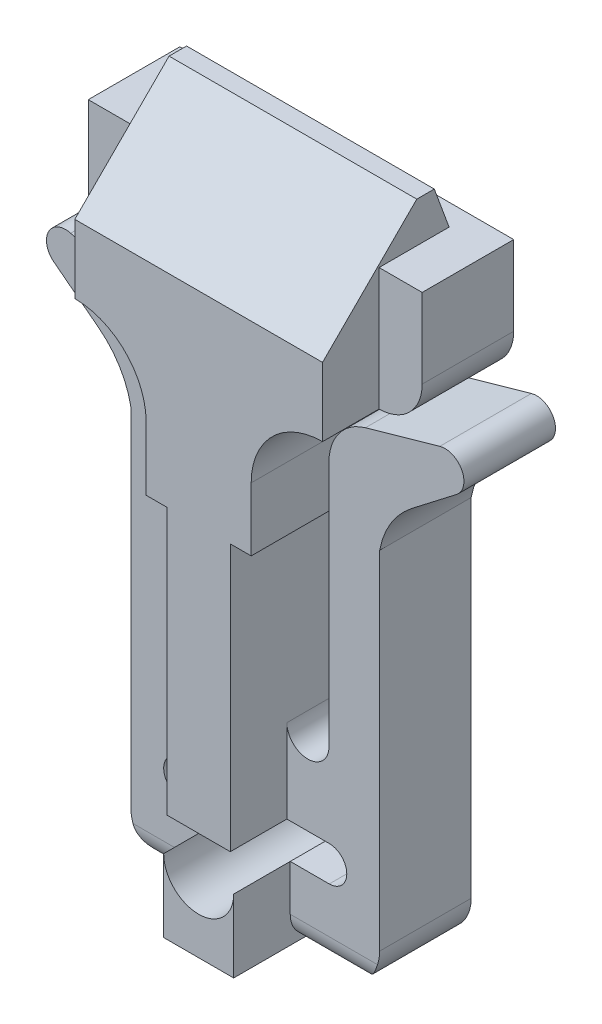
ISO-10303-21;
HEADER;
FILE_DESCRIPTION(('STEP AP214'),'2;1');
FILE_NAME('part.step','',(''),(''),'','','');
FILE_SCHEMA(('AUTOMOTIVE_DESIGN { 1 0 10303 214 1 1 1 1 }'));
ENDSEC;
DATA;
#1=APPLICATION_CONTEXT('core data for automotive mechanical design processes');
#2=APPLICATION_PROTOCOL_DEFINITION('international standard','automotive_design',2000,#1);
#3=PRODUCT_CONTEXT('',#1,'mechanical');
#4=PRODUCT('Part','Part','',(#3));
#5=PRODUCT_RELATED_PRODUCT_CATEGORY('part','',(#4));
#6=PRODUCT_DEFINITION_FORMATION('','',#4);
#7=PRODUCT_DEFINITION_CONTEXT('part definition',#1,'design');
#8=PRODUCT_DEFINITION('design','',#6,#7);
#9=PRODUCT_DEFINITION_SHAPE('','',#8);
#10=(LENGTH_UNIT() NAMED_UNIT(*) SI_UNIT(.MILLI.,.METRE.));
#11=(NAMED_UNIT(*) PLANE_ANGLE_UNIT() SI_UNIT($,.RADIAN.));
#12=(NAMED_UNIT(*) SI_UNIT($,.STERADIAN.) SOLID_ANGLE_UNIT());
#13=UNCERTAINTY_MEASURE_WITH_UNIT(LENGTH_MEASURE(1.E-05),#10,'distance_accuracy_value','');
#14=(GEOMETRIC_REPRESENTATION_CONTEXT(3) GLOBAL_UNCERTAINTY_ASSIGNED_CONTEXT((#13)) GLOBAL_UNIT_ASSIGNED_CONTEXT((#10,
#11,#12)) REPRESENTATION_CONTEXT('',''));
#15=CARTESIAN_POINT('',(0.,0.,0.));
#16=DIRECTION('',(0.,0.,1.));
#17=DIRECTION('',(1.,0.,0.));
#18=AXIS2_PLACEMENT_3D('',#15,#16,#17);
#19=CARTESIAN_POINT('',(0.,-3.,2.4));
#20=DIRECTION('',(1.,0.,0.));
#21=DIRECTION('',(0.,0.,-1.));
#22=AXIS2_PLACEMENT_3D('',#19,#20,#21);
#23=CYLINDRICAL_SURFACE('',#22,1.);
#24=CARTESIAN_POINT('',(-0.125,-3.,2.4));
#25=DIRECTION('',(1.,0.,0.));
#26=DIRECTION('',(0.,1.,0.));
#27=AXIS2_PLACEMENT_3D('',#24,#25,#26);
#28=CIRCLE('',#27,1.);
#29=CARTESIAN_POINT('',(-0.125,-3.,3.4));
#30=VERTEX_POINT('',#29);
#31=CARTESIAN_POINT('',(-0.125,-4.,2.4));
#32=VERTEX_POINT('',#31);
#33=EDGE_CURVE('E10',#30,#32,#28,.T.);
#34=ORIENTED_EDGE('',*,*,#33,.F.);
#35=DIRECTION('',(1.,0.,0.));
#36=VECTOR('',#35,1.);
#37=CARTESIAN_POINT('',(-0.125,-3.,3.4));
#38=LINE('',#37,#36);
#39=CARTESIAN_POINT('',(-3.36612312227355,-3.,3.4));
#40=VERTEX_POINT('',#39);
#41=EDGE_CURVE('E151',#40,#30,#38,.T.);
#42=ORIENTED_EDGE('',*,*,#41,.F.);
#43=CARTESIAN_POINT('',(-3.36612312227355,-3.,3.4));
#44=CARTESIAN_POINT('',(-3.35664906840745,-3.02795051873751,3.40000256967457));
#45=CARTESIAN_POINT('',(-3.34633379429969,-3.05558881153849,3.39882811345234));
#46=CARTESIAN_POINT('',(-3.3241544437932,-3.11000766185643,3.39430454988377));
#47=CARTESIAN_POINT('',(-3.31229272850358,-3.13678945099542,3.39095872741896));
#48=CARTESIAN_POINT('',(-3.27481006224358,-3.21506444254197,3.3780197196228));
#49=CARTESIAN_POINT('',(-3.24708387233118,-3.26509219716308,3.36551702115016));
#50=CARTESIAN_POINT('',(-3.18047615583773,-3.37073084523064,3.33075723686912));
#51=CARTESIAN_POINT('',(-3.14048486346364,-3.42511188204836,3.30694991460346));
#52=CARTESIAN_POINT('',(-3.05546740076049,-3.52612642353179,3.25235272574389));
#53=CARTESIAN_POINT('',(-3.01041974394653,-3.57272459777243,3.22153244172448));
#54=CARTESIAN_POINT('',(-2.89878857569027,-3.67451548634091,3.14206242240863));
#55=CARTESIAN_POINT('',(-2.830585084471,-3.72612226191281,3.09111405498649));
#56=CARTESIAN_POINT('',(-2.68999294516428,-3.81534504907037,2.98320087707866));
#57=CARTESIAN_POINT('',(-2.61759817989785,-3.85293998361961,2.92622716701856));
#58=CARTESIAN_POINT('',(-2.45184101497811,-3.92291481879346,2.79389174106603));
#59=CARTESIAN_POINT('',(-2.35776697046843,-3.95163247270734,2.71749758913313));
#60=CARTESIAN_POINT('',(-2.1680711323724,-3.98995674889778,2.56232671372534));
#61=CARTESIAN_POINT('',(-2.07245312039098,-3.99960451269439,2.48355549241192));
#62=CARTESIAN_POINT('',(-1.97498903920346,-3.99999601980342,2.40325408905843));
#63=CARTESIAN_POINT('',(-1.97301422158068,-3.9999999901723,2.40162701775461));
#64=CARTESIAN_POINT('',(-1.97103946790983,-4.,2.4));
#65=B_SPLINE_CURVE_WITH_KNOTS('',3,(#43,#44,#45,#46,#47,#48,#49,#50,#51,#52,#53,#54,#55,#56,#57,
#58,#59,#60,#61,#62,#63,#64),.UNSPECIFIED.,.F.,.F.,(4,2,2,2,2,2,2,2,2,2,4),(0.,
0.0884578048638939,0.176782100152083,0.351541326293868,0.565136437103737,0.779676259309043,
1.07671809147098,1.37420495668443,1.74617255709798,2.11733679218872,2.12501307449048),.UNSPECIFIED.);
#66=CARTESIAN_POINT('',(-1.97103946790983,-4.,2.4));
#67=VERTEX_POINT('',#66);
#68=EDGE_CURVE('E20',#67,#40,#65,.F.);
#69=ORIENTED_EDGE('',*,*,#68,.F.);
#70=DIRECTION('',(-1.,0.,0.));
#71=VECTOR('',#70,1.);
#72=CARTESIAN_POINT('',(-1.97103946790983,-4.,2.4));
#73=LINE('',#72,#71);
#74=EDGE_CURVE('E131',#32,#67,#73,.T.);
#75=ORIENTED_EDGE('',*,*,#74,.F.);
#76=EDGE_LOOP('',(#34,#42,#69,#75));
#77=FACE_BOUND('',#76,.T.);
#78=ADVANCED_FACE('F16',(#77),#23,.T.);
#79=CARTESIAN_POINT('',(0.,-3.,2.4));
#80=DIRECTION('',(1.,0.,0.));
#81=DIRECTION('',(0.,0.,-1.));
#82=AXIS2_PLACEMENT_3D('',#79,#80,#81);
#83=CYLINDRICAL_SURFACE('',#82,1.);
#84=CARTESIAN_POINT('',(5.71612312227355,-3.,3.4));
#85=CARTESIAN_POINT('',(5.70664906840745,-3.02795051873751,3.40000256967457));
#86=CARTESIAN_POINT('',(5.69633379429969,-3.05558881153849,3.39882811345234));
#87=CARTESIAN_POINT('',(5.67415444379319,-3.11000766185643,3.39430454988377));
#88=CARTESIAN_POINT('',(5.66229272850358,-3.13678945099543,3.39095872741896));
#89=CARTESIAN_POINT('',(5.62481006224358,-3.21506444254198,3.3780197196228));
#90=CARTESIAN_POINT('',(5.59708387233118,-3.26509219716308,3.36551702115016));
#91=CARTESIAN_POINT('',(5.53047615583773,-3.37073084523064,3.33075723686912));
#92=CARTESIAN_POINT('',(5.49048486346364,-3.42511188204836,3.30694991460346));
#93=CARTESIAN_POINT('',(5.40546740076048,-3.52612642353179,3.25235272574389));
#94=CARTESIAN_POINT('',(5.36041974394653,-3.57272459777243,3.22153244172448));
#95=CARTESIAN_POINT('',(5.24878857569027,-3.67451548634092,3.14206242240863));
#96=CARTESIAN_POINT('',(5.180585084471,-3.72612226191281,3.09111405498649));
#97=CARTESIAN_POINT('',(5.03999294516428,-3.81534504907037,2.98320087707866));
#98=CARTESIAN_POINT('',(4.96759817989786,-3.85293998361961,2.92622716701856));
#99=CARTESIAN_POINT('',(4.80184101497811,-3.92291481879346,2.79389174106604));
#100=CARTESIAN_POINT('',(4.70776697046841,-3.95163247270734,2.71749758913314));
#101=CARTESIAN_POINT('',(4.51807113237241,-3.98995674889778,2.56232671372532));
#102=CARTESIAN_POINT('',(4.42245312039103,-3.99960451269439,2.48355549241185));
#103=CARTESIAN_POINT('',(4.32498903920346,-3.99999601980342,2.40325408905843));
#104=CARTESIAN_POINT('',(4.32301422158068,-3.9999999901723,2.4016270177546));
#105=CARTESIAN_POINT('',(4.32103946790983,-4.,2.4));
#106=B_SPLINE_CURVE_WITH_KNOTS('',3,(#84,#85,#86,#87,#88,#89,#90,#91,#92,#93,#94,#95,#96,#97,
#98,#99,#100,#101,#102,#103,#104,#105),.UNSPECIFIED.,.F.,.F.,(4,2,2,2,2,2,2,2,2,2,4),(0.,
0.0884578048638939,0.176782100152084,0.351541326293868,0.565136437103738,0.779676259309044,
1.07671809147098,1.37420495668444,1.74617255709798,2.11733679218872,2.12501307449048),.UNSPECIFIED.);
#107=CARTESIAN_POINT('',(5.71612312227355,-3.,3.4));
#108=VERTEX_POINT('',#107);
#109=CARTESIAN_POINT('',(4.32103946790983,-4.,2.4));
#110=VERTEX_POINT('',#109);
#111=EDGE_CURVE('E146',#108,#110,#106,.T.);
#112=ORIENTED_EDGE('',*,*,#111,.F.);
#113=DIRECTION('',(1.,0.,0.));
#114=VECTOR('',#113,1.);
#115=CARTESIAN_POINT('',(4.32103946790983,-3.,3.4));
#116=LINE('',#115,#114);
#117=CARTESIAN_POINT('',(2.475,-3.,3.4));
#118=VERTEX_POINT('',#117);
#119=EDGE_CURVE('E831',#118,#108,#116,.T.);
#120=ORIENTED_EDGE('',*,*,#119,.F.);
#121=CARTESIAN_POINT('',(2.475,-3.,2.4));
#122=DIRECTION('',(-1.,0.,0.));
#123=DIRECTION('',(0.,0.,1.));
#124=AXIS2_PLACEMENT_3D('',#121,#122,#123);
#125=CIRCLE('',#124,1.);
#126=CARTESIAN_POINT('',(2.475,-4.,2.4));
#127=VERTEX_POINT('',#126);
#128=EDGE_CURVE('E1768',#127,#118,#125,.T.);
#129=ORIENTED_EDGE('',*,*,#128,.F.);
#130=DIRECTION('',(-1.,0.,0.));
#131=VECTOR('',#130,1.);
#132=CARTESIAN_POINT('',(2.475,-4.,2.4));
#133=LINE('',#132,#131);
#134=EDGE_CURVE('E1118',#110,#127,#133,.T.);
#135=ORIENTED_EDGE('',*,*,#134,.F.);
#136=EDGE_LOOP('',(#112,#120,#129,#135));
#137=FACE_BOUND('',#136,.T.);
#138=ADVANCED_FACE('F190',(#137),#83,.T.);
#139=CARTESIAN_POINT('',(0.,0.,5.5));
#140=DIRECTION('',(0.,0.,1.));
#141=DIRECTION('',(1.,0.,0.));
#142=AXIS2_PLACEMENT_3D('',#139,#140,#141);
#143=PLANE('',#142);
#144=DIRECTION('',(0.,-1.,0.));
#145=VECTOR('',#144,1.);
#146=CARTESIAN_POINT('',(-0.125,0.,5.5));
#147=LINE('',#146,#145);
#148=CARTESIAN_POINT('',(-0.125,-1.3,5.5));
#149=VERTEX_POINT('',#148);
#150=CARTESIAN_POINT('',(-0.125,-4.,5.5));
#151=VERTEX_POINT('',#150);
#152=EDGE_CURVE('E32',#149,#151,#147,.T.);
#153=ORIENTED_EDGE('',*,*,#152,.T.);
#154=DIRECTION('',(1.,0.,0.));
#155=VECTOR('',#154,1.);
#156=CARTESIAN_POINT('',(0.,-4.,5.5));
#157=LINE('',#156,#155);
#158=CARTESIAN_POINT('',(2.475,-4.,5.5));
#159=VERTEX_POINT('',#158);
#160=EDGE_CURVE('E1049',#151,#159,#157,.T.);
#161=ORIENTED_EDGE('',*,*,#160,.T.);
#162=DIRECTION('',(0.,1.,0.));
#163=VECTOR('',#162,1.);
#164=CARTESIAN_POINT('',(2.475,0.,5.5));
#165=LINE('',#164,#163);
#166=CARTESIAN_POINT('',(2.475,-1.3,5.5));
#167=VERTEX_POINT('',#166);
#168=EDGE_CURVE('E47',#159,#167,#165,.T.);
#169=ORIENTED_EDGE('',*,*,#168,.T.);
#170=CARTESIAN_POINT('',(1.175,-1.3,5.5));
#171=DIRECTION('',(0.,0.,-1.));
#172=DIRECTION('',(1.,0.,0.));
#173=AXIS2_PLACEMENT_3D('',#170,#171,#172);
#174=CIRCLE('',#173,1.3);
#175=EDGE_CURVE('E1579',#167,#149,#174,.T.);
#176=ORIENTED_EDGE('',*,*,#175,.T.);
#177=EDGE_LOOP('',(#153,#161,#169,#176));
#178=FACE_BOUND('',#177,.T.);
#179=ADVANCED_FACE('F194',(#178),#143,.T.);
#180=CARTESIAN_POINT('',(-0.125,0.,9.24833296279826));
#181=DIRECTION('',(1.,0.,0.));
#182=DIRECTION('',(0.,1.,0.));
#183=AXIS2_PLACEMENT_3D('',#180,#181,#182);
#184=PLANE('',#183);
#185=ORIENTED_EDGE('',*,*,#152,.F.);
#186=DIRECTION('',(0.,0.,-1.));
#187=VECTOR('',#186,1.);
#188=CARTESIAN_POINT('',(-0.125,-1.3,9.24833296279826));
#189=LINE('',#188,#187);
#190=CARTESIAN_POINT('',(-0.125,-1.3,3.4));
#191=VERTEX_POINT('',#190);
#192=EDGE_CURVE('E1745',#149,#191,#189,.T.);
#193=ORIENTED_EDGE('',*,*,#192,.T.);
#194=DIRECTION('',(0.,-1.,0.));
#195=VECTOR('',#194,1.);
#196=CARTESIAN_POINT('',(-0.125,0.,3.4));
#197=LINE('',#196,#195);
#198=EDGE_CURVE('E175',#191,#30,#197,.T.);
#199=ORIENTED_EDGE('',*,*,#198,.T.);
#200=ORIENTED_EDGE('',*,*,#33,.T.);
#201=DIRECTION('',(0.,0.,-1.));
#202=VECTOR('',#201,1.);
#203=CARTESIAN_POINT('',(-0.125,-4.,9.24833296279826));
#204=LINE('',#203,#202);
#205=EDGE_CURVE('E142',#151,#32,#204,.T.);
#206=ORIENTED_EDGE('',*,*,#205,.F.);
#207=EDGE_LOOP('',(#185,#193,#199,#200,#206));
#208=FACE_BOUND('',#207,.T.);
#209=ADVANCED_FACE('F198',(#208),#184,.F.);
#210=CARTESIAN_POINT('',(2.475,0.,9.24833296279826));
#211=DIRECTION('',(-1.,0.,0.));
#212=DIRECTION('',(0.,0.,1.));
#213=AXIS2_PLACEMENT_3D('',#210,#211,#212);
#214=PLANE('',#213);
#215=ORIENTED_EDGE('',*,*,#168,.F.);
#216=DIRECTION('',(0.,0.,-1.));
#217=VECTOR('',#216,1.);
#218=CARTESIAN_POINT('',(2.475,-4.,9.24833296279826));
#219=LINE('',#218,#217);
#220=EDGE_CURVE('E1052',#159,#127,#219,.T.);
#221=ORIENTED_EDGE('',*,*,#220,.T.);
#222=ORIENTED_EDGE('',*,*,#128,.T.);
#223=DIRECTION('',(0.,1.,0.));
#224=VECTOR('',#223,1.);
#225=CARTESIAN_POINT('',(2.475,0.,3.4));
#226=LINE('',#225,#224);
#227=CARTESIAN_POINT('',(2.475,-1.3,3.4));
#228=VERTEX_POINT('',#227);
#229=EDGE_CURVE('E836',#118,#228,#226,.T.);
#230=ORIENTED_EDGE('',*,*,#229,.T.);
#231=DIRECTION('',(0.,0.,-1.));
#232=VECTOR('',#231,1.);
#233=CARTESIAN_POINT('',(2.475,-1.3,9.24833296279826));
#234=LINE('',#233,#232);
#235=EDGE_CURVE('E1574',#167,#228,#234,.T.);
#236=ORIENTED_EDGE('',*,*,#235,.F.);
#237=EDGE_LOOP('',(#215,#221,#222,#230,#236));
#238=FACE_BOUND('',#237,.T.);
#239=ADVANCED_FACE('F201',(#238),#214,.F.);
#240=CARTESIAN_POINT('',(-1.575,-0.65,0.));
#241=DIRECTION('',(0.,0.,1.));
#242=DIRECTION('',(1.,0.,0.));
#243=AXIS2_PLACEMENT_3D('',#240,#241,#242);
#244=CYLINDRICAL_SURFACE('',#243,0.65);
#245=CARTESIAN_POINT('',(-1.575,-0.65,3.4));
#246=DIRECTION('',(0.,0.,1.));
#247=DIRECTION('',(1.,0.,0.));
#248=AXIS2_PLACEMENT_3D('',#245,#246,#247);
#249=CIRCLE('',#248,0.65);
#250=CARTESIAN_POINT('',(-1.575,0.,3.4));
#251=VERTEX_POINT('',#250);
#252=CARTESIAN_POINT('',(-1.575,-1.3,3.4));
#253=VERTEX_POINT('',#252);
#254=EDGE_CURVE('E1010',#251,#253,#249,.T.);
#255=ORIENTED_EDGE('',*,*,#254,.T.);
#256=DIRECTION('',(0.,0.,1.));
#257=VECTOR('',#256,1.);
#258=CARTESIAN_POINT('',(-1.575,-1.3,0.));
#259=LINE('',#258,#257);
#260=CARTESIAN_POINT('',(-1.575,-1.3,0.));
#261=VERTEX_POINT('',#260);
#262=EDGE_CURVE('E1578',#261,#253,#259,.T.);
#263=ORIENTED_EDGE('',*,*,#262,.F.);
#264=CARTESIAN_POINT('',(-1.575,-0.65,0.));
#265=DIRECTION('',(0.,0.,1.));
#266=DIRECTION('',(1.,0.,0.));
#267=AXIS2_PLACEMENT_3D('',#264,#265,#266);
#268=CIRCLE('',#267,0.65);
#269=CARTESIAN_POINT('',(-1.575,0.,0.));
#270=VERTEX_POINT('',#269);
#271=EDGE_CURVE('E1125',#270,#261,#268,.T.);
#272=ORIENTED_EDGE('',*,*,#271,.F.);
#273=DIRECTION('',(0.,0.,1.));
#274=VECTOR('',#273,1.);
#275=CARTESIAN_POINT('',(-1.575,0.,0.));
#276=LINE('',#275,#274);
#277=EDGE_CURVE('E1223',#270,#251,#276,.T.);
#278=ORIENTED_EDGE('',*,*,#277,.T.);
#279=EDGE_LOOP('',(#255,#263,#272,#278));
#280=FACE_BOUND('',#279,.T.);
#281=ADVANCED_FACE('F203',(#280),#244,.F.);
#282=CARTESIAN_POINT('',(0.,-1.3,0.));
#283=DIRECTION('',(0.,-1.,0.));
#284=DIRECTION('',(0.,0.,-1.));
#285=AXIS2_PLACEMENT_3D('',#282,#283,#284);
#286=PLANE('',#285);
#287=DIRECTION('',(1.,0.,0.));
#288=VECTOR('',#287,1.);
#289=CARTESIAN_POINT('',(0.,-1.3,3.4));
#290=LINE('',#289,#288);
#291=EDGE_CURVE('E1006',#253,#191,#290,.T.);
#292=ORIENTED_EDGE('',*,*,#291,.T.);
#293=DIRECTION('',(0.,0.,1.));
#294=VECTOR('',#293,1.);
#295=CARTESIAN_POINT('',(-0.125,-1.3,0.));
#296=LINE('',#295,#294);
#297=CARTESIAN_POINT('',(-0.125,-1.3,0.));
#298=VERTEX_POINT('',#297);
#299=EDGE_CURVE('E1738',#298,#191,#296,.T.);
#300=ORIENTED_EDGE('',*,*,#299,.F.);
#301=DIRECTION('',(1.,0.,0.));
#302=VECTOR('',#301,1.);
#303=CARTESIAN_POINT('',(0.,-1.3,0.));
#304=LINE('',#303,#302);
#305=EDGE_CURVE('E1129',#261,#298,#304,.T.);
#306=ORIENTED_EDGE('',*,*,#305,.F.);
#307=ORIENTED_EDGE('',*,*,#262,.T.);
#308=EDGE_LOOP('',(#292,#300,#306,#307));
#309=FACE_BOUND('',#308,.T.);
#310=ADVANCED_FACE('F206',(#309),#286,.F.);
#311=CARTESIAN_POINT('',(1.175,-1.3,0.));
#312=DIRECTION('',(0.,0.,1.));
#313=DIRECTION('',(1.,0.,0.));
#314=AXIS2_PLACEMENT_3D('',#311,#312,#313);
#315=CYLINDRICAL_SURFACE('',#314,1.3);
#316=ORIENTED_EDGE('',*,*,#299,.T.);
#317=ORIENTED_EDGE('',*,*,#192,.F.);
#318=ORIENTED_EDGE('',*,*,#175,.F.);
#319=ORIENTED_EDGE('',*,*,#235,.T.);
#320=DIRECTION('',(0.,0.,1.));
#321=VECTOR('',#320,1.);
#322=CARTESIAN_POINT('',(2.475,-1.3,0.));
#323=LINE('',#322,#321);
#324=CARTESIAN_POINT('',(2.475,-1.3,0.));
#325=VERTEX_POINT('',#324);
#326=EDGE_CURVE('E1731',#325,#228,#323,.T.);
#327=ORIENTED_EDGE('',*,*,#326,.F.);
#328=CARTESIAN_POINT('',(1.175,-1.3,0.));
#329=DIRECTION('',(0.,0.,1.));
#330=DIRECTION('',(1.,0.,0.));
#331=AXIS2_PLACEMENT_3D('',#328,#329,#330);
#332=CIRCLE('',#331,1.3);
#333=EDGE_CURVE('E1264',#298,#325,#332,.T.);
#334=ORIENTED_EDGE('',*,*,#333,.F.);
#335=EDGE_LOOP('',(#316,#317,#318,#319,#327,#334));
#336=FACE_BOUND('',#335,.T.);
#337=ADVANCED_FACE('F210',(#336),#315,.F.);
#338=CARTESIAN_POINT('',(0.,-1.3,0.));
#339=DIRECTION('',(0.,-1.,0.));
#340=DIRECTION('',(0.,0.,-1.));
#341=AXIS2_PLACEMENT_3D('',#338,#339,#340);
#342=PLANE('',#341);
#343=DIRECTION('',(1.,0.,0.));
#344=VECTOR('',#343,1.);
#345=CARTESIAN_POINT('',(0.,-1.3,3.4));
#346=LINE('',#345,#344);
#347=CARTESIAN_POINT('',(3.925,-1.3,3.4));
#348=VERTEX_POINT('',#347);
#349=EDGE_CURVE('E178',#228,#348,#346,.T.);
#350=ORIENTED_EDGE('',*,*,#349,.T.);
#351=DIRECTION('',(0.,0.,1.));
#352=VECTOR('',#351,1.);
#353=CARTESIAN_POINT('',(3.925,-1.3,0.));
#354=LINE('',#353,#352);
#355=CARTESIAN_POINT('',(3.925,-1.3,0.));
#356=VERTEX_POINT('',#355);
#357=EDGE_CURVE('E1724',#356,#348,#354,.T.);
#358=ORIENTED_EDGE('',*,*,#357,.F.);
#359=DIRECTION('',(1.,0.,0.));
#360=VECTOR('',#359,1.);
#361=CARTESIAN_POINT('',(0.,-1.3,0.));
#362=LINE('',#361,#360);
#363=EDGE_CURVE('E1260',#325,#356,#362,.T.);
#364=ORIENTED_EDGE('',*,*,#363,.F.);
#365=ORIENTED_EDGE('',*,*,#326,.T.);
#366=EDGE_LOOP('',(#350,#358,#364,#365));
#367=FACE_BOUND('',#366,.T.);
#368=ADVANCED_FACE('F214',(#367),#342,.F.);
#369=CARTESIAN_POINT('',(-3.42500057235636,16.5,3.4));
#370=DIRECTION('',(0.,0.,-1.));
#371=DIRECTION('',(0.,-1.,0.));
#372=AXIS2_PLACEMENT_3D('',#369,#370,#371);
#373=PLANE('',#372);
#374=DIRECTION('',(0.,1.,0.));
#375=VECTOR('',#374,1.);
#376=CARTESIAN_POINT('',(-5.02500057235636,16.5,3.4));
#377=LINE('',#376,#375);
#378=CARTESIAN_POINT('',(-5.02500057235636,16.5,3.4));
#379=VERTEX_POINT('',#378);
#380=CARTESIAN_POINT('',(-5.02500057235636,19.45,3.4));
#381=VERTEX_POINT('',#380);
#382=EDGE_CURVE('E1710',#379,#381,#377,.T.);
#383=ORIENTED_EDGE('',*,*,#382,.F.);
#384=CARTESIAN_POINT('',(-3.42500057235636,16.5,3.4));
#385=DIRECTION('',(0.,0.,-1.));
#386=DIRECTION('',(-1.,0.,0.));
#387=AXIS2_PLACEMENT_3D('',#384,#385,#386);
#388=CIRCLE('',#387,1.6);
#389=CARTESIAN_POINT('',(-3.42500009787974,14.9,3.4));
#390=VERTEX_POINT('',#389);
#391=EDGE_CURVE('E1717',#390,#379,#388,.T.);
#392=ORIENTED_EDGE('',*,*,#391,.F.);
#393=DIRECTION('',(-7.83037863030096E-08,-1.,0.));
#394=VECTOR('',#393,1.);
#395=CARTESIAN_POINT('',(-3.42500009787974,19.45,3.4));
#396=LINE('',#395,#394);
#397=CARTESIAN_POINT('',(-3.42500009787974,19.45,3.4));
#398=VERTEX_POINT('',#397);
#399=EDGE_CURVE('E1320',#398,#390,#396,.T.);
#400=ORIENTED_EDGE('',*,*,#399,.F.);
#401=DIRECTION('',(1.,0.,0.));
#402=VECTOR('',#401,1.);
#403=CARTESIAN_POINT('',(-5.02500057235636,19.45,3.4));
#404=LINE('',#403,#402);
#405=EDGE_CURVE('E1596',#381,#398,#404,.T.);
#406=ORIENTED_EDGE('',*,*,#405,.F.);
#407=EDGE_LOOP('',(#383,#392,#400,#406));
#408=FACE_BOUND('',#407,.T.);
#409=ADVANCED_FACE('F220',(#408),#373,.F.);
#410=CARTESIAN_POINT('',(-3.42500057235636,16.5,3.4));
#411=DIRECTION('',(0.,0.,-1.));
#412=DIRECTION('',(-1.,0.,0.));
#413=AXIS2_PLACEMENT_3D('',#410,#411,#412);
#414=CYLINDRICAL_SURFACE('',#413,1.6);
#415=CARTESIAN_POINT('',(-3.42500057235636,16.5,0.));
#416=DIRECTION('',(0.,0.,-1.));
#417=DIRECTION('',(-1.,0.,0.));
#418=AXIS2_PLACEMENT_3D('',#415,#416,#417);
#419=CIRCLE('',#418,1.6);
#420=CARTESIAN_POINT('',(-3.42500009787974,14.9,0.));
#421=VERTEX_POINT('',#420);
#422=CARTESIAN_POINT('',(-5.02500057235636,16.5,0.));
#423=VERTEX_POINT('',#422);
#424=EDGE_CURVE('E1180',#421,#423,#419,.T.);
#425=ORIENTED_EDGE('',*,*,#424,.F.);
#426=DIRECTION('',(0.,0.,-1.));
#427=VECTOR('',#426,1.);
#428=CARTESIAN_POINT('',(-3.42500045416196,14.9,3.4));
#429=LINE('',#428,#427);
#430=EDGE_CURVE('E1379',#390,#421,#429,.T.);
#431=ORIENTED_EDGE('',*,*,#430,.F.);
#432=ORIENTED_EDGE('',*,*,#391,.T.);
#433=DIRECTION('',(0.,0.,-1.));
#434=VECTOR('',#433,1.);
#435=CARTESIAN_POINT('',(-5.02500057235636,16.5,3.4));
#436=LINE('',#435,#434);
#437=EDGE_CURVE('E1703',#379,#423,#436,.T.);
#438=ORIENTED_EDGE('',*,*,#437,.T.);
#439=EDGE_LOOP('',(#425,#431,#432,#438));
#440=FACE_BOUND('',#439,.T.);
#441=ADVANCED_FACE('F216',(#440),#414,.T.);
#442=CARTESIAN_POINT('',(-5.02500057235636,16.5,3.4));
#443=DIRECTION('',(-1.,0.,0.));
#444=DIRECTION('',(0.,0.,1.));
#445=AXIS2_PLACEMENT_3D('',#442,#443,#444);
#446=PLANE('',#445);
#447=DIRECTION('',(0.,1.,0.));
#448=VECTOR('',#447,1.);
#449=CARTESIAN_POINT('',(-5.02500057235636,16.5,0.));
#450=LINE('',#449,#448);
#451=CARTESIAN_POINT('',(-5.02500057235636,19.45,0.));
#452=VERTEX_POINT('',#451);
#453=EDGE_CURVE('E1176',#423,#452,#450,.T.);
#454=ORIENTED_EDGE('',*,*,#453,.F.);
#455=ORIENTED_EDGE('',*,*,#437,.F.);
#456=ORIENTED_EDGE('',*,*,#382,.T.);
#457=DIRECTION('',(0.,0.,-1.));
#458=VECTOR('',#457,1.);
#459=CARTESIAN_POINT('',(-5.02500057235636,19.45,3.4));
#460=LINE('',#459,#458);
#461=EDGE_CURVE('E1592',#381,#452,#460,.T.);
#462=ORIENTED_EDGE('',*,*,#461,.T.);
#463=EDGE_LOOP('',(#454,#455,#456,#462));
#464=FACE_BOUND('',#463,.T.);
#465=ADVANCED_FACE('F219',(#464),#446,.T.);
#466=CARTESIAN_POINT('',(5.77500021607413,16.5,3.4));
#467=DIRECTION('',(0.,0.,1.));
#468=DIRECTION('',(1.,0.,0.));
#469=AXIS2_PLACEMENT_3D('',#466,#467,#468);
#470=PLANE('',#469);
#471=CARTESIAN_POINT('',(5.77500021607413,16.5,3.4));
#472=DIRECTION('',(0.,0.,-1.));
#473=DIRECTION('',(1.,0.,0.));
#474=AXIS2_PLACEMENT_3D('',#471,#472,#473);
#475=CIRCLE('',#474,1.6);
#476=CARTESIAN_POINT('',(7.37500021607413,16.5,3.4));
#477=VERTEX_POINT('',#476);
#478=CARTESIAN_POINT('',(5.77500009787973,14.9,3.4));
#479=VERTEX_POINT('',#478);
#480=EDGE_CURVE('E1693',#477,#479,#475,.T.);
#481=ORIENTED_EDGE('',*,*,#480,.F.);
#482=DIRECTION('',(0.,-1.,0.));
#483=VECTOR('',#482,1.);
#484=CARTESIAN_POINT('',(7.37500021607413,16.5,3.4));
#485=LINE('',#484,#483);
#486=CARTESIAN_POINT('',(7.37500021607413,19.45,3.4));
#487=VERTEX_POINT('',#486);
#488=EDGE_CURVE('E1697',#487,#477,#485,.T.);
#489=ORIENTED_EDGE('',*,*,#488,.F.);
#490=DIRECTION('',(1.,0.,0.));
#491=VECTOR('',#490,1.);
#492=CARTESIAN_POINT('',(7.37500021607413,19.45,3.4));
#493=LINE('',#492,#491);
#494=CARTESIAN_POINT('',(5.77499974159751,19.45,3.4));
#495=VERTEX_POINT('',#494);
#496=EDGE_CURVE('E1676',#495,#487,#493,.T.);
#497=ORIENTED_EDGE('',*,*,#496,.F.);
#498=DIRECTION('',(-7.83037861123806E-08,1.,0.));
#499=VECTOR('',#498,1.);
#500=CARTESIAN_POINT('',(5.77499974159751,19.45,3.4));
#501=LINE('',#500,#499);
#502=EDGE_CURVE('E876',#479,#495,#501,.T.);
#503=ORIENTED_EDGE('',*,*,#502,.F.);
#504=EDGE_LOOP('',(#481,#489,#497,#503));
#505=FACE_BOUND('',#504,.T.);
#506=ADVANCED_FACE('F224',(#505),#470,.T.);
#507=CARTESIAN_POINT('',(7.37500021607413,16.5,3.4));
#508=DIRECTION('',(1.,0.,0.));
#509=DIRECTION('',(0.,1.,0.));
#510=AXIS2_PLACEMENT_3D('',#507,#508,#509);
#511=PLANE('',#510);
#512=DIRECTION('',(0.,-1.,0.));
#513=VECTOR('',#512,1.);
#514=CARTESIAN_POINT('',(7.37500021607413,16.5,0.));
#515=LINE('',#514,#513);
#516=CARTESIAN_POINT('',(7.37500021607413,19.45,0.));
#517=VERTEX_POINT('',#516);
#518=CARTESIAN_POINT('',(7.37500021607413,16.5,0.));
#519=VERTEX_POINT('',#518);
#520=EDGE_CURVE('E927',#517,#519,#515,.T.);
#521=ORIENTED_EDGE('',*,*,#520,.F.);
#522=DIRECTION('',(0.,0.,-1.));
#523=VECTOR('',#522,1.);
#524=CARTESIAN_POINT('',(7.37500021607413,19.45,3.4));
#525=LINE('',#524,#523);
#526=EDGE_CURVE('E1683',#487,#517,#525,.T.);
#527=ORIENTED_EDGE('',*,*,#526,.F.);
#528=ORIENTED_EDGE('',*,*,#488,.T.);
#529=DIRECTION('',(0.,0.,-1.));
#530=VECTOR('',#529,1.);
#531=CARTESIAN_POINT('',(7.37500021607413,16.5,3.4));
#532=LINE('',#531,#530);
#533=EDGE_CURVE('E811',#477,#519,#532,.T.);
#534=ORIENTED_EDGE('',*,*,#533,.T.);
#535=EDGE_LOOP('',(#521,#527,#528,#534));
#536=FACE_BOUND('',#535,.T.);
#537=ADVANCED_FACE('F226',(#536),#511,.T.);
#538=CARTESIAN_POINT('',(5.77500021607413,16.5,3.4));
#539=DIRECTION('',(0.,0.,-1.));
#540=DIRECTION('',(-1.,0.,0.));
#541=AXIS2_PLACEMENT_3D('',#538,#539,#540);
#542=CYLINDRICAL_SURFACE('',#541,1.6);
#543=CARTESIAN_POINT('',(5.77500021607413,16.5,0.));
#544=DIRECTION('',(0.,0.,-1.));
#545=DIRECTION('',(1.,0.,0.));
#546=AXIS2_PLACEMENT_3D('',#543,#544,#545);
#547=CIRCLE('',#546,1.6);
#548=CARTESIAN_POINT('',(5.77500009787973,14.9,0.));
#549=VERTEX_POINT('',#548);
#550=EDGE_CURVE('E922',#519,#549,#547,.T.);
#551=ORIENTED_EDGE('',*,*,#550,.F.);
#552=ORIENTED_EDGE('',*,*,#533,.F.);
#553=ORIENTED_EDGE('',*,*,#480,.T.);
#554=DIRECTION('',(0.,0.,-1.));
#555=VECTOR('',#554,1.);
#556=CARTESIAN_POINT('',(5.77500009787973,14.9,3.4));
#557=LINE('',#556,#555);
#558=EDGE_CURVE('E818',#479,#549,#557,.T.);
#559=ORIENTED_EDGE('',*,*,#558,.T.);
#560=EDGE_LOOP('',(#551,#552,#553,#559));
#561=FACE_BOUND('',#560,.T.);
#562=ADVANCED_FACE('F229',(#561),#542,.T.);
#563=CARTESIAN_POINT('',(8.92662787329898,11.475,11.475));
#564=DIRECTION('',(0.,-0.707106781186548,-0.707106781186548));
#565=DIRECTION('',(0.,0.707106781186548,-0.707106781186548));
#566=AXIS2_PLACEMENT_3D('',#563,#564,#565);
#567=PLANE('',#566);
#568=DIRECTION('',(-5.53691380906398E-08,0.707106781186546,-0.707106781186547));
#569=VECTOR('',#568,1.);
#570=CARTESIAN_POINT('',(5.77500058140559,8.72500022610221,14.2249997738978));
#571=LINE('',#570,#569);
#572=CARTESIAN_POINT('',(5.77500009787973,17.45,5.5));
#573=VERTEX_POINT('',#572);
#574=CARTESIAN_POINT('',(5.77499990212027,20.95,2.));
#575=VERTEX_POINT('',#574);
#576=EDGE_CURVE('E1408',#573,#575,#571,.T.);
#577=ORIENTED_EDGE('',*,*,#576,.T.);
#578=DIRECTION('',(-1.,0.,0.));
#579=VECTOR('',#578,1.);
#580=CARTESIAN_POINT('',(8.92662787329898,20.95,2.));
#581=LINE('',#580,#579);
#582=CARTESIAN_POINT('',(-3.42500009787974,20.95,2.));
#583=VERTEX_POINT('',#582);
#584=EDGE_CURVE('E1321',#575,#583,#581,.T.);
#585=ORIENTED_EDGE('',*,*,#584,.T.);
#586=DIRECTION('',(0.,-0.707106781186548,0.707106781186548));
#587=VECTOR('',#586,1.);
#588=CARTESIAN_POINT('',(-3.42500009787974,8.725,14.225));
#589=LINE('',#588,#587);
#590=CARTESIAN_POINT('',(-3.42500009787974,17.45,5.5));
#591=VERTEX_POINT('',#590);
#592=EDGE_CURVE('E1503',#583,#591,#589,.T.);
#593=ORIENTED_EDGE('',*,*,#592,.T.);
#594=DIRECTION('',(1.,0.,0.));
#595=VECTOR('',#594,1.);
#596=CARTESIAN_POINT('',(0.,17.45,5.5));
#597=LINE('',#596,#595);
#598=EDGE_CURVE('E861',#591,#573,#597,.T.);
#599=ORIENTED_EDGE('',*,*,#598,.T.);
#600=EDGE_LOOP('',(#577,#585,#593,#599));
#601=FACE_BOUND('',#600,.T.);
#602=ADVANCED_FACE('F233',(#601),#567,.F.);
#603=CARTESIAN_POINT('',(8.92662787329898,19.45,0.));
#604=DIRECTION('',(0.,1.,0.));
#605=DIRECTION('',(1.,0.,0.));
#606=AXIS2_PLACEMENT_3D('',#603,#604,#605);
#607=PLANE('',#606);
#608=DIRECTION('',(-1.,0.,0.));
#609=VECTOR('',#608,1.);
#610=CARTESIAN_POINT('',(0.,19.45,0.));
#611=LINE('',#610,#609);
#612=EDGE_CURVE('E1201',#517,#452,#611,.T.);
#613=ORIENTED_EDGE('',*,*,#612,.T.);
#614=ORIENTED_EDGE('',*,*,#461,.F.);
#615=ORIENTED_EDGE('',*,*,#405,.T.);
#616=DIRECTION('',(0.,0.,-1.));
#617=VECTOR('',#616,1.);
#618=CARTESIAN_POINT('',(-3.42500009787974,19.45,3.4));
#619=LINE('',#618,#617);
#620=CARTESIAN_POINT('',(-3.42500009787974,19.45,0.8));
#621=VERTEX_POINT('',#620);
#622=EDGE_CURVE('E1316',#398,#621,#619,.T.);
#623=ORIENTED_EDGE('',*,*,#622,.T.);
#624=DIRECTION('',(-1.,0.,0.));
#625=VECTOR('',#624,1.);
#626=CARTESIAN_POINT('',(8.92662787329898,19.45,0.8));
#627=LINE('',#626,#625);
#628=CARTESIAN_POINT('',(5.77499974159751,19.45,0.8));
#629=VERTEX_POINT('',#628);
#630=EDGE_CURVE('E1597',#629,#621,#627,.T.);
#631=ORIENTED_EDGE('',*,*,#630,.F.);
#632=DIRECTION('',(0.,0.,-1.));
#633=VECTOR('',#632,1.);
#634=CARTESIAN_POINT('',(5.77499974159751,19.45,3.4));
#635=LINE('',#634,#633);
#636=EDGE_CURVE('E1064',#495,#629,#635,.T.);
#637=ORIENTED_EDGE('',*,*,#636,.F.);
#638=ORIENTED_EDGE('',*,*,#496,.T.);
#639=ORIENTED_EDGE('',*,*,#526,.T.);
#640=EDGE_LOOP('',(#613,#614,#615,#623,#631,#637,#638,#639));
#641=FACE_BOUND('',#640,.T.);
#642=ADVANCED_FACE('F235',(#641),#607,.T.);
#643=CARTESIAN_POINT('',(8.92662787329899,2.04647404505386,-5.58129285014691));
#644=DIRECTION('',(0.,0.344254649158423,-0.938876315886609));
#645=DIRECTION('',(-1.,0.,0.));
#646=AXIS2_PLACEMENT_3D('',#643,#644,#645);
#647=PLANE('',#646);
#648=ORIENTED_EDGE('',*,*,#630,.T.);
#649=DIRECTION('',(0.,-0.938876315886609,-0.344254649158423));
#650=VECTOR('',#649,1.);
#651=CARTESIAN_POINT('',(-3.42500009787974,3.8241429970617,-4.92948090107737));
#652=LINE('',#651,#650);
#653=CARTESIAN_POINT('',(-3.42500009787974,20.95,1.35));
#654=VERTEX_POINT('',#653);
#655=EDGE_CURVE('E1507',#654,#621,#652,.T.);
#656=ORIENTED_EDGE('',*,*,#655,.F.);
#657=DIRECTION('',(-1.,0.,0.));
#658=VECTOR('',#657,1.);
#659=CARTESIAN_POINT('',(8.92662787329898,20.95,1.35));
#660=LINE('',#659,#658);
#661=CARTESIAN_POINT('',(5.77499990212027,20.95,1.35));
#662=VERTEX_POINT('',#661);
#663=EDGE_CURVE('E871',#662,#654,#660,.T.);
#664=ORIENTED_EDGE('',*,*,#663,.F.);
#665=DIRECTION('',(-7.35175701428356E-08,0.938876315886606,0.344254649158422));
#666=VECTOR('',#665,1.);
#667=CARTESIAN_POINT('',(5.77500096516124,3.82414339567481,-4.92948075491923));
#668=LINE('',#667,#666);
#669=EDGE_CURVE('E1059',#629,#662,#668,.T.);
#670=ORIENTED_EDGE('',*,*,#669,.F.);
#671=EDGE_LOOP('',(#648,#656,#664,#670));
#672=FACE_BOUND('',#671,.T.);
#673=ADVANCED_FACE('F238',(#672),#647,.T.);
#674=CARTESIAN_POINT('',(3.13086222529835,3.1,3.4));
#675=DIRECTION('',(0.,0.,-1.));
#676=DIRECTION('',(-1.,0.,0.));
#677=AXIS2_PLACEMENT_3D('',#674,#675,#676);
#678=CYLINDRICAL_SURFACE('',#677,0.780862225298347);
#679=CARTESIAN_POINT('',(3.13086222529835,3.1,0.));
#680=DIRECTION('',(0.,0.,1.));
#681=DIRECTION('',(-1.,0.,0.));
#682=AXIS2_PLACEMENT_3D('',#679,#680,#681);
#683=CIRCLE('',#682,0.780862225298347);
#684=CARTESIAN_POINT('',(2.35,3.1,0.));
#685=VERTEX_POINT('',#684);
#686=CARTESIAN_POINT('',(3.91172445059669,3.1,0.));
#687=VERTEX_POINT('',#686);
#688=EDGE_CURVE('E1148',#685,#687,#683,.T.);
#689=ORIENTED_EDGE('',*,*,#688,.F.);
#690=DIRECTION('',(0.,0.,-1.));
#691=VECTOR('',#690,1.);
#692=CARTESIAN_POINT('',(2.35,3.1,3.4));
#693=LINE('',#692,#691);
#694=CARTESIAN_POINT('',(2.35,3.1,3.4));
#695=VERTEX_POINT('',#694);
#696=EDGE_CURVE('E910',#695,#685,#693,.T.);
#697=ORIENTED_EDGE('',*,*,#696,.F.);
#698=CARTESIAN_POINT('',(3.13086222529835,3.1,3.4));
#699=DIRECTION('',(0.,0.,1.));
#700=DIRECTION('',(-1.,0.,0.));
#701=AXIS2_PLACEMENT_3D('',#698,#699,#700);
#702=CIRCLE('',#701,0.780862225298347);
#703=CARTESIAN_POINT('',(3.91172445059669,3.1,3.4));
#704=VERTEX_POINT('',#703);
#705=EDGE_CURVE('E969',#695,#704,#702,.T.);
#706=ORIENTED_EDGE('',*,*,#705,.T.);
#707=DIRECTION('',(0.,0.,-1.));
#708=VECTOR('',#707,1.);
#709=CARTESIAN_POINT('',(3.91172445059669,3.1,3.4));
#710=LINE('',#709,#708);
#711=EDGE_CURVE('E1658',#704,#687,#710,.T.);
#712=ORIENTED_EDGE('',*,*,#711,.T.);
#713=EDGE_LOOP('',(#689,#697,#706,#712));
#714=FACE_BOUND('',#713,.T.);
#715=ADVANCED_FACE('F242',(#714),#678,.F.);
#716=CARTESIAN_POINT('',(3.91172445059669,0.,3.4));
#717=DIRECTION('',(-1.,0.,0.));
#718=DIRECTION('',(0.,0.,1.));
#719=AXIS2_PLACEMENT_3D('',#716,#717,#718);
#720=PLANE('',#719);
#721=DIRECTION('',(0.,1.,0.));
#722=VECTOR('',#721,1.);
#723=CARTESIAN_POINT('',(3.91172445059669,0.,0.));
#724=LINE('',#723,#722);
#725=CARTESIAN_POINT('',(3.91172445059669,12.2500000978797,0.));
#726=VERTEX_POINT('',#725);
#727=EDGE_CURVE('E1152',#687,#726,#724,.T.);
#728=ORIENTED_EDGE('',*,*,#727,.F.);
#729=ORIENTED_EDGE('',*,*,#711,.F.);
#730=DIRECTION('',(0.,1.,0.));
#731=VECTOR('',#730,1.);
#732=CARTESIAN_POINT('',(3.91172445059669,0.,3.4));
#733=LINE('',#732,#731);
#734=CARTESIAN_POINT('',(3.91172445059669,12.2500000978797,3.4));
#735=VERTEX_POINT('',#734);
#736=EDGE_CURVE('E850',#704,#735,#733,.T.);
#737=ORIENTED_EDGE('',*,*,#736,.T.);
#738=DIRECTION('',(0.,0.,-1.));
#739=VECTOR('',#738,1.);
#740=CARTESIAN_POINT('',(3.91172445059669,12.2500000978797,3.4));
#741=LINE('',#740,#739);
#742=EDGE_CURVE('E1651',#735,#726,#741,.T.);
#743=ORIENTED_EDGE('',*,*,#742,.T.);
#744=EDGE_LOOP('',(#728,#729,#737,#743));
#745=FACE_BOUND('',#744,.T.);
#746=ADVANCED_FACE('F244',(#745),#720,.T.);
#747=CARTESIAN_POINT('',(5.77499990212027,12.2500000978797,3.4));
#748=DIRECTION('',(0.,0.,-1.));
#749=DIRECTION('',(-1.,0.,0.));
#750=AXIS2_PLACEMENT_3D('',#747,#748,#749);
#751=CYLINDRICAL_SURFACE('',#750,1.86327545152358);
#752=CARTESIAN_POINT('',(5.77499990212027,12.2500000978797,0.));
#753=DIRECTION('',(0.,0.,-1.));
#754=DIRECTION('',(-1.,0.,0.));
#755=AXIS2_PLACEMENT_3D('',#752,#753,#754);
#756=CIRCLE('',#755,1.86327545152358);
#757=CARTESIAN_POINT('',(5.2663336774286,14.04249949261,0.));
#758=VERTEX_POINT('',#757);
#759=EDGE_CURVE('E1194',#726,#758,#756,.T.);
#760=ORIENTED_EDGE('',*,*,#759,.F.);
#761=ORIENTED_EDGE('',*,*,#742,.F.);
#762=CARTESIAN_POINT('',(5.77499990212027,12.2500000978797,3.4));
#763=DIRECTION('',(0.,0.,-1.));
#764=DIRECTION('',(-1.,0.,0.));
#765=AXIS2_PLACEMENT_3D('',#762,#763,#764);
#766=CIRCLE('',#765,1.86327545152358);
#767=CARTESIAN_POINT('',(5.2663336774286,14.04249949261,3.4));
#768=VERTEX_POINT('',#767);
#769=EDGE_CURVE('E847',#735,#768,#766,.T.);
#770=ORIENTED_EDGE('',*,*,#769,.T.);
#771=DIRECTION('',(0.,0.,-1.));
#772=VECTOR('',#771,1.);
#773=CARTESIAN_POINT('',(5.2663336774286,14.04249949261,3.4));
#774=LINE('',#773,#772);
#775=EDGE_CURVE('E1644',#768,#758,#774,.T.);
#776=ORIENTED_EDGE('',*,*,#775,.T.);
#777=EDGE_LOOP('',(#760,#761,#770,#776));
#778=FACE_BOUND('',#777,.T.);
#779=ADVANCED_FACE('F247',(#778),#751,.T.);
#780=CARTESIAN_POINT('',(-3.2954438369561,11.6128824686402,3.4));
#781=DIRECTION('',(-0.272995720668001,0.962015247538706,0.));
#782=DIRECTION('',(0.,0.,1.));
#783=AXIS2_PLACEMENT_3D('',#780,#781,#782);
#784=PLANE('',#783);
#785=DIRECTION('',(0.962015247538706,0.272995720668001,0.));
#786=VECTOR('',#785,1.);
#787=CARTESIAN_POINT('',(-3.2954438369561,11.6128824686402,0.));
#788=LINE('',#787,#786);
#789=CARTESIAN_POINT('',(8.02921841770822,14.8265366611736,0.));
#790=VERTEX_POINT('',#789);
#791=EDGE_CURVE('E1144',#758,#790,#788,.T.);
#792=ORIENTED_EDGE('',*,*,#791,.F.);
#793=ORIENTED_EDGE('',*,*,#775,.F.);
#794=DIRECTION('',(0.962015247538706,0.272995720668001,0.));
#795=VECTOR('',#794,1.);
#796=CARTESIAN_POINT('',(-3.2954438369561,11.6128824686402,3.4));
#797=LINE('',#796,#795);
#798=CARTESIAN_POINT('',(8.02921841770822,14.8265366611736,3.4));
#799=VERTEX_POINT('',#798);
#800=EDGE_CURVE('E851',#768,#799,#797,.T.);
#801=ORIENTED_EDGE('',*,*,#800,.T.);
#802=DIRECTION('',(0.,0.,-1.));
#803=VECTOR('',#802,1.);
#804=CARTESIAN_POINT('',(8.02921841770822,14.8265366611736,3.4));
#805=LINE('',#804,#803);
#806=EDGE_CURVE('E1637',#799,#790,#805,.T.);
#807=ORIENTED_EDGE('',*,*,#806,.T.);
#808=EDGE_LOOP('',(#792,#793,#801,#807));
#809=FACE_BOUND('',#808,.T.);
#810=ADVANCED_FACE('F422',(#809),#784,.T.);
#811=CARTESIAN_POINT('',(8.22166913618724,14.1483556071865,3.4));
#812=DIRECTION('',(0.,0.,-1.));
#813=DIRECTION('',(-1.,0.,0.));
#814=AXIS2_PLACEMENT_3D('',#811,#812,#813);
#815=CYLINDRICAL_SURFACE('',#814,0.704958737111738);
#816=CARTESIAN_POINT('',(8.22166913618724,14.1483556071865,0.));
#817=DIRECTION('',(0.,0.,-1.));
#818=DIRECTION('',(-1.,0.,0.));
#819=AXIS2_PLACEMENT_3D('',#816,#817,#818);
#820=CIRCLE('',#819,0.704958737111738);
#821=CARTESIAN_POINT('',(8.65197304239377,13.5899602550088,0.));
#822=VERTEX_POINT('',#821);
#823=EDGE_CURVE('E1140',#790,#822,#820,.T.);
#824=ORIENTED_EDGE('',*,*,#823,.F.);
#825=ORIENTED_EDGE('',*,*,#806,.F.);
#826=CARTESIAN_POINT('',(8.22166913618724,14.1483556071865,3.4));
#827=DIRECTION('',(0.,0.,-1.));
#828=DIRECTION('',(-1.,0.,0.));
#829=AXIS2_PLACEMENT_3D('',#826,#827,#828);
#830=CIRCLE('',#829,0.704958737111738);
#831=CARTESIAN_POINT('',(8.65197304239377,13.5899602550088,3.4));
#832=VERTEX_POINT('',#831);
#833=EDGE_CURVE('E931',#799,#832,#830,.T.);
#834=ORIENTED_EDGE('',*,*,#833,.T.);
#835=DIRECTION('',(0.,0.,-1.));
#836=VECTOR('',#835,1.);
#837=CARTESIAN_POINT('',(8.65197304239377,13.5899602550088,3.4));
#838=LINE('',#837,#836);
#839=EDGE_CURVE('E1630',#832,#822,#838,.T.);
#840=ORIENTED_EDGE('',*,*,#839,.T.);
#841=EDGE_LOOP('',(#824,#825,#834,#840));
#842=FACE_BOUND('',#841,.T.);
#843=ADVANCED_FACE('F253',(#842),#815,.T.);
#844=CARTESIAN_POINT('',(-3.34706389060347,4.34340681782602,3.4));
#845=DIRECTION('',(0.610395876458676,-0.792096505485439,0.));
#846=DIRECTION('',(0.,0.,-1.));
#847=AXIS2_PLACEMENT_3D('',#844,#845,#846);
#848=PLANE('',#847);
#849=DIRECTION('',(-0.792096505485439,-0.610395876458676,0.));
#850=VECTOR('',#849,1.);
#851=CARTESIAN_POINT('',(-3.34706389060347,4.34340681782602,0.));
#852=LINE('',#851,#850);
#853=CARTESIAN_POINT('',(6.98497439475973,12.3053578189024,0.));
#854=VERTEX_POINT('',#853);
#855=EDGE_CURVE('E1002',#822,#854,#852,.T.);
#856=ORIENTED_EDGE('',*,*,#855,.F.);
#857=ORIENTED_EDGE('',*,*,#839,.F.);
#858=DIRECTION('',(-0.792096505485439,-0.610395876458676,0.));
#859=VECTOR('',#858,1.);
#860=CARTESIAN_POINT('',(-3.34706389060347,4.34340681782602,3.4));
#861=LINE('',#860,#859);
#862=CARTESIAN_POINT('',(6.98497439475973,12.3053578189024,3.4));
#863=VERTEX_POINT('',#862);
#864=EDGE_CURVE('E918',#832,#863,#861,.T.);
#865=ORIENTED_EDGE('',*,*,#864,.T.);
#866=DIRECTION('',(0.,0.,-1.));
#867=VECTOR('',#866,1.);
#868=CARTESIAN_POINT('',(6.98497439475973,12.3053578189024,3.4));
#869=LINE('',#868,#867);
#870=EDGE_CURVE('E1623',#863,#854,#869,.T.);
#871=ORIENTED_EDGE('',*,*,#870,.T.);
#872=EDGE_LOOP('',(#856,#857,#865,#871));
#873=FACE_BOUND('',#872,.T.);
#874=ADVANCED_FACE('F249',(#873),#848,.T.);
#875=CARTESIAN_POINT('',(8.93633353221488,9.77312453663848,3.4));
#876=DIRECTION('',(0.,0.,-1.));
#877=DIRECTION('',(-1.,0.,0.));
#878=AXIS2_PLACEMENT_3D('',#875,#876,#877);
#879=CYLINDRICAL_SURFACE('',#878,3.19687470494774);
#880=CARTESIAN_POINT('',(8.93633353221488,9.77312453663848,0.));
#881=DIRECTION('',(0.,0.,1.));
#882=DIRECTION('',(-1.,0.,0.));
#883=AXIS2_PLACEMENT_3D('',#880,#881,#882);
#884=CIRCLE('',#883,3.19687470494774);
#885=CARTESIAN_POINT('',(5.79416866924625,10.3620284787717,0.));
#886=VERTEX_POINT('',#885);
#887=EDGE_CURVE('E997',#854,#886,#884,.T.);
#888=ORIENTED_EDGE('',*,*,#887,.F.);
#889=ORIENTED_EDGE('',*,*,#870,.F.);
#890=CARTESIAN_POINT('',(8.93633353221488,9.77312453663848,3.4));
#891=DIRECTION('',(0.,0.,1.));
#892=DIRECTION('',(-1.,0.,0.));
#893=AXIS2_PLACEMENT_3D('',#890,#891,#892);
#894=CIRCLE('',#893,3.19687470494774);
#895=CARTESIAN_POINT('',(5.79416866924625,10.3620284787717,3.4));
#896=VERTEX_POINT('',#895);
#897=EDGE_CURVE('E843',#863,#896,#894,.T.);
#898=ORIENTED_EDGE('',*,*,#897,.T.);
#899=DIRECTION('',(0.,0.,-1.));
#900=VECTOR('',#899,1.);
#901=CARTESIAN_POINT('',(5.79416866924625,10.3620284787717,3.4));
#902=LINE('',#901,#900);
#903=EDGE_CURVE('E1616',#896,#886,#902,.T.);
#904=ORIENTED_EDGE('',*,*,#903,.T.);
#905=EDGE_LOOP('',(#888,#889,#898,#904));
#906=FACE_BOUND('',#905,.T.);
#907=ADVANCED_FACE('F252',(#906),#879,.F.);
#908=CARTESIAN_POINT('',(5.79416866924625,0.,3.4));
#909=DIRECTION('',(1.,0.,0.));
#910=DIRECTION('',(0.,-1.,0.));
#911=AXIS2_PLACEMENT_3D('',#908,#909,#910);
#912=PLANE('',#911);
#913=DIRECTION('',(0.,-1.,0.));
#914=VECTOR('',#913,1.);
#915=CARTESIAN_POINT('',(5.79416866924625,0.,0.));
#916=LINE('',#915,#914);
#917=CARTESIAN_POINT('',(5.79416866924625,-2.52687079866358,0.));
#918=VERTEX_POINT('',#917);
#919=EDGE_CURVE('E1001',#886,#918,#916,.T.);
#920=ORIENTED_EDGE('',*,*,#919,.F.);
#921=ORIENTED_EDGE('',*,*,#903,.F.);
#922=DIRECTION('',(0.,-1.,0.));
#923=VECTOR('',#922,1.);
#924=CARTESIAN_POINT('',(5.79416866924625,0.,3.4));
#925=LINE('',#924,#923);
#926=CARTESIAN_POINT('',(5.79416866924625,-2.52687079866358,3.4));
#927=VERTEX_POINT('',#926);
#928=EDGE_CURVE('E840',#896,#927,#925,.T.);
#929=ORIENTED_EDGE('',*,*,#928,.T.);
#930=DIRECTION('',(0.,0.,-1.));
#931=VECTOR('',#930,1.);
#932=CARTESIAN_POINT('',(5.79416866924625,-2.52687079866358,3.4));
#933=LINE('',#932,#931);
#934=EDGE_CURVE('E185',#927,#918,#933,.T.);
#935=ORIENTED_EDGE('',*,*,#934,.T.);
#936=EDGE_LOOP('',(#920,#921,#929,#935));
#937=FACE_BOUND('',#936,.T.);
#938=ADVANCED_FACE('F255',(#937),#912,.T.);
#939=CARTESIAN_POINT('',(4.32103946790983,-2.52687079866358,3.4));
#940=DIRECTION('',(0.,0.,-1.));
#941=DIRECTION('',(-1.,0.,0.));
#942=AXIS2_PLACEMENT_3D('',#939,#940,#941);
#943=CYLINDRICAL_SURFACE('',#942,1.47312920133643);
#944=CARTESIAN_POINT('',(4.32103946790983,-2.52687079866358,3.4));
#945=DIRECTION('',(0.,0.,-1.));
#946=DIRECTION('',(-1.,0.,0.));
#947=AXIS2_PLACEMENT_3D('',#944,#945,#946);
#948=CIRCLE('',#947,1.47312920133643);
#949=EDGE_CURVE('E835',#927,#108,#948,.T.);
#950=ORIENTED_EDGE('',*,*,#949,.T.);
#951=ORIENTED_EDGE('',*,*,#111,.T.);
#952=DIRECTION('',(0.,0.,-1.));
#953=VECTOR('',#952,1.);
#954=CARTESIAN_POINT('',(4.32103946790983,-4.,3.4));
#955=LINE('',#954,#953);
#956=CARTESIAN_POINT('',(4.32103946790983,-4.,0.));
#957=VERTEX_POINT('',#956);
#958=EDGE_CURVE('E156',#110,#957,#955,.T.);
#959=ORIENTED_EDGE('',*,*,#958,.T.);
#960=CARTESIAN_POINT('',(4.32103946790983,-2.52687079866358,0.));
#961=DIRECTION('',(0.,0.,-1.));
#962=DIRECTION('',(-1.,0.,0.));
#963=AXIS2_PLACEMENT_3D('',#960,#961,#962);
#964=CIRCLE('',#963,1.47312920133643);
#965=EDGE_CURVE('E1312',#918,#957,#964,.T.);
#966=ORIENTED_EDGE('',*,*,#965,.F.);
#967=ORIENTED_EDGE('',*,*,#934,.F.);
#968=EDGE_LOOP('',(#950,#951,#959,#966,#967));
#969=FACE_BOUND('',#968,.T.);
#970=ADVANCED_FACE('F186',(#969),#943,.T.);
#971=CARTESIAN_POINT('',(0.,-4.,3.4));
#972=DIRECTION('',(0.,-1.,0.));
#973=DIRECTION('',(0.,0.,-1.));
#974=AXIS2_PLACEMENT_3D('',#971,#972,#973);
#975=PLANE('',#974);
#976=ORIENTED_EDGE('',*,*,#958,.F.);
#977=ORIENTED_EDGE('',*,*,#134,.T.);
#978=ORIENTED_EDGE('',*,*,#220,.F.);
#979=ORIENTED_EDGE('',*,*,#160,.F.);
#980=ORIENTED_EDGE('',*,*,#205,.T.);
#981=ORIENTED_EDGE('',*,*,#74,.T.);
#982=DIRECTION('',(0.,0.,-1.));
#983=VECTOR('',#982,1.);
#984=CARTESIAN_POINT('',(-1.97103946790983,-4.,3.4));
#985=LINE('',#984,#983);
#986=CARTESIAN_POINT('',(-1.97103946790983,-4.,0.));
#987=VERTEX_POINT('',#986);
#988=EDGE_CURVE('E138',#67,#987,#985,.T.);
#989=ORIENTED_EDGE('',*,*,#988,.T.);
#990=DIRECTION('',(-1.,0.,0.));
#991=VECTOR('',#990,1.);
#992=CARTESIAN_POINT('',(0.,-4.,0.));
#993=LINE('',#992,#991);
#994=EDGE_CURVE('E1187',#957,#987,#993,.T.);
#995=ORIENTED_EDGE('',*,*,#994,.F.);
#996=EDGE_LOOP('',(#976,#977,#978,#979,#980,#981,#989,#995));
#997=FACE_BOUND('',#996,.T.);
#998=ADVANCED_FACE('F134',(#997),#975,.T.);
#999=CARTESIAN_POINT('',(-1.97103946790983,-2.52687079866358,3.4));
#1000=DIRECTION('',(0.,0.,-1.));
#1001=DIRECTION('',(-1.,0.,0.));
#1002=AXIS2_PLACEMENT_3D('',#999,#1000,#1001);
#1003=CYLINDRICAL_SURFACE('',#1002,1.47312920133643);
#1004=ORIENTED_EDGE('',*,*,#988,.F.);
#1005=ORIENTED_EDGE('',*,*,#68,.T.);
#1006=CARTESIAN_POINT('',(-1.97103946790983,-2.52687079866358,3.4));
#1007=DIRECTION('',(0.,0.,1.));
#1008=DIRECTION('',(-1.,0.,0.));
#1009=AXIS2_PLACEMENT_3D('',#1006,#1007,#1008);
#1010=CIRCLE('',#1009,1.47312920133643);
#1011=CARTESIAN_POINT('',(-3.44416866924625,-2.52687079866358,3.4));
#1012=VERTEX_POINT('',#1011);
#1013=EDGE_CURVE('E176',#1012,#40,#1010,.T.);
#1014=ORIENTED_EDGE('',*,*,#1013,.F.);
#1015=DIRECTION('',(0.,0.,-1.));
#1016=VECTOR('',#1015,1.);
#1017=CARTESIAN_POINT('',(-3.44416866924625,-2.52687079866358,3.4));
#1018=LINE('',#1017,#1016);
#1019=CARTESIAN_POINT('',(-3.44416866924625,-2.52687079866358,0.));
#1020=VERTEX_POINT('',#1019);
#1021=EDGE_CURVE('E163',#1012,#1020,#1018,.T.);
#1022=ORIENTED_EDGE('',*,*,#1021,.T.);
#1023=CARTESIAN_POINT('',(-1.97103946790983,-2.52687079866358,0.));
#1024=DIRECTION('',(0.,0.,1.));
#1025=DIRECTION('',(-1.,0.,0.));
#1026=AXIS2_PLACEMENT_3D('',#1023,#1024,#1025);
#1027=CIRCLE('',#1026,1.47312920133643);
#1028=EDGE_CURVE('E160',#1020,#987,#1027,.T.);
#1029=ORIENTED_EDGE('',*,*,#1028,.T.);
#1030=EDGE_LOOP('',(#1004,#1005,#1014,#1022,#1029));
#1031=FACE_BOUND('',#1030,.T.);
#1032=ADVANCED_FACE('F157',(#1031),#1003,.T.);
#1033=CARTESIAN_POINT('',(-3.44416866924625,0.,3.4));
#1034=DIRECTION('',(1.,0.,0.));
#1035=DIRECTION('',(0.,1.,0.));
#1036=AXIS2_PLACEMENT_3D('',#1033,#1034,#1035);
#1037=PLANE('',#1036);
#1038=DIRECTION('',(0.,-1.,0.));
#1039=VECTOR('',#1038,1.);
#1040=CARTESIAN_POINT('',(-3.44416866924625,0.,0.));
#1041=LINE('',#1040,#1039);
#1042=CARTESIAN_POINT('',(-3.44416866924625,10.3620284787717,0.));
#1043=VERTEX_POINT('',#1042);
#1044=EDGE_CURVE('E1186',#1043,#1020,#1041,.T.);
#1045=ORIENTED_EDGE('',*,*,#1044,.T.);
#1046=ORIENTED_EDGE('',*,*,#1021,.F.);
#1047=DIRECTION('',(0.,-1.,0.));
#1048=VECTOR('',#1047,1.);
#1049=CARTESIAN_POINT('',(-3.44416866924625,0.,3.4));
#1050=LINE('',#1049,#1048);
#1051=CARTESIAN_POINT('',(-3.44416866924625,10.3620284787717,3.4));
#1052=VERTEX_POINT('',#1051);
#1053=EDGE_CURVE('E1172',#1052,#1012,#1050,.T.);
#1054=ORIENTED_EDGE('',*,*,#1053,.F.);
#1055=DIRECTION('',(0.,0.,-1.));
#1056=VECTOR('',#1055,1.);
#1057=CARTESIAN_POINT('',(-3.44416866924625,10.3620284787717,3.4));
#1058=LINE('',#1057,#1056);
#1059=EDGE_CURVE('E169',#1052,#1043,#1058,.T.);
#1060=ORIENTED_EDGE('',*,*,#1059,.T.);
#1061=EDGE_LOOP('',(#1045,#1046,#1054,#1060));
#1062=FACE_BOUND('',#1061,.T.);
#1063=ADVANCED_FACE('F497',(#1062),#1037,.F.);
#1064=CARTESIAN_POINT('',(-6.58633353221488,9.77312453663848,3.4));
#1065=DIRECTION('',(0.,0.,-1.));
#1066=DIRECTION('',(-1.,0.,0.));
#1067=AXIS2_PLACEMENT_3D('',#1064,#1065,#1066);
#1068=CYLINDRICAL_SURFACE('',#1067,3.19687470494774);
#1069=CARTESIAN_POINT('',(-6.58633353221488,9.77312453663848,0.));
#1070=DIRECTION('',(0.,0.,-1.));
#1071=DIRECTION('',(-1.,0.,0.));
#1072=AXIS2_PLACEMENT_3D('',#1069,#1070,#1071);
#1073=CIRCLE('',#1072,3.19687470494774);
#1074=CARTESIAN_POINT('',(-4.63497439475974,12.3053578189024,0.));
#1075=VERTEX_POINT('',#1074);
#1076=EDGE_CURVE('E1256',#1075,#1043,#1073,.T.);
#1077=ORIENTED_EDGE('',*,*,#1076,.T.);
#1078=ORIENTED_EDGE('',*,*,#1059,.F.);
#1079=CARTESIAN_POINT('',(-6.58633353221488,9.77312453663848,3.4));
#1080=DIRECTION('',(0.,0.,-1.));
#1081=DIRECTION('',(-1.,0.,0.));
#1082=AXIS2_PLACEMENT_3D('',#1079,#1080,#1081);
#1083=CIRCLE('',#1082,3.19687470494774);
#1084=CARTESIAN_POINT('',(-4.63497439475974,12.3053578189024,3.4));
#1085=VERTEX_POINT('',#1084);
#1086=EDGE_CURVE('E1165',#1085,#1052,#1083,.T.);
#1087=ORIENTED_EDGE('',*,*,#1086,.F.);
#1088=DIRECTION('',(0.,0.,-1.));
#1089=VECTOR('',#1088,1.);
#1090=CARTESIAN_POINT('',(-4.63497439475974,12.3053578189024,3.4));
#1091=LINE('',#1090,#1089);
#1092=EDGE_CURVE('E1345',#1085,#1075,#1091,.T.);
#1093=ORIENTED_EDGE('',*,*,#1092,.T.);
#1094=EDGE_LOOP('',(#1077,#1078,#1087,#1093));
#1095=FACE_BOUND('',#1094,.T.);
#1096=ADVANCED_FACE('F505',(#1095),#1068,.F.);
#1097=CARTESIAN_POINT('',(4.22263423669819,5.47961405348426,3.4));
#1098=DIRECTION('',(0.610395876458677,0.792096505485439,0.));
#1099=DIRECTION('',(0.,0.,-1.));
#1100=AXIS2_PLACEMENT_3D('',#1097,#1098,#1099);
#1101=PLANE('',#1100);
#1102=DIRECTION('',(0.792096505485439,-0.610395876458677,0.));
#1103=VECTOR('',#1102,1.);
#1104=CARTESIAN_POINT('',(4.22263423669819,5.47961405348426,0.));
#1105=LINE('',#1104,#1103);
#1106=CARTESIAN_POINT('',(-6.30197304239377,13.5899602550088,0.));
#1107=VERTEX_POINT('',#1106);
#1108=EDGE_CURVE('E1251',#1107,#1075,#1105,.T.);
#1109=ORIENTED_EDGE('',*,*,#1108,.T.);
#1110=ORIENTED_EDGE('',*,*,#1092,.F.);
#1111=DIRECTION('',(0.792096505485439,-0.610395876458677,0.));
#1112=VECTOR('',#1111,1.);
#1113=CARTESIAN_POINT('',(4.22263423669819,5.47961405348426,3.4));
#1114=LINE('',#1113,#1112);
#1115=CARTESIAN_POINT('',(-6.30197304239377,13.5899602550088,3.4));
#1116=VERTEX_POINT('',#1115);
#1117=EDGE_CURVE('E1079',#1116,#1085,#1114,.T.);
#1118=ORIENTED_EDGE('',*,*,#1117,.F.);
#1119=DIRECTION('',(0.,0.,-1.));
#1120=VECTOR('',#1119,1.);
#1121=CARTESIAN_POINT('',(-6.30197304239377,13.5899602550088,3.4));
#1122=LINE('',#1121,#1120);
#1123=EDGE_CURVE('E773',#1116,#1107,#1122,.T.);
#1124=ORIENTED_EDGE('',*,*,#1123,.T.);
#1125=EDGE_LOOP('',(#1109,#1110,#1118,#1124));
#1126=FACE_BOUND('',#1125,.T.);
#1127=ADVANCED_FACE('F515',(#1126),#1101,.F.);
#1128=CARTESIAN_POINT('',(3.47058149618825,12.2300536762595,3.4));
#1129=DIRECTION('',(-0.272995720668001,-0.962015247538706,0.));
#1130=DIRECTION('',(-0.962015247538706,0.272995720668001,0.));
#1131=AXIS2_PLACEMENT_3D('',#1128,#1129,#1130);
#1132=PLANE('',#1131);
#1133=DIRECTION('',(-0.962015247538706,0.272995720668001,0.));
#1134=VECTOR('',#1133,1.);
#1135=CARTESIAN_POINT('',(3.47058149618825,12.2300536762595,0.));
#1136=LINE('',#1135,#1134);
#1137=CARTESIAN_POINT('',(-2.9163336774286,14.04249949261,0.));
#1138=VERTEX_POINT('',#1137);
#1139=CARTESIAN_POINT('',(-5.67921841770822,14.8265366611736,0.));
#1140=VERTEX_POINT('',#1139);
#1141=EDGE_CURVE('E1255',#1138,#1140,#1136,.T.);
#1142=ORIENTED_EDGE('',*,*,#1141,.T.);
#1143=DIRECTION('',(0.,0.,-1.));
#1144=VECTOR('',#1143,1.);
#1145=CARTESIAN_POINT('',(-5.67921841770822,14.8265366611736,3.4));
#1146=LINE('',#1145,#1144);
#1147=CARTESIAN_POINT('',(-5.67921841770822,14.8265366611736,3.4));
#1148=VERTEX_POINT('',#1147);
#1149=EDGE_CURVE('E1483',#1148,#1140,#1146,.T.);
#1150=ORIENTED_EDGE('',*,*,#1149,.F.);
#1151=DIRECTION('',(-0.962015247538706,0.272995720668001,0.));
#1152=VECTOR('',#1151,1.);
#1153=CARTESIAN_POINT('',(3.47058149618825,12.2300536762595,3.4));
#1154=LINE('',#1153,#1152);
#1155=CARTESIAN_POINT('',(-2.9163336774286,14.04249949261,3.4));
#1156=VERTEX_POINT('',#1155);
#1157=EDGE_CURVE('E977',#1156,#1148,#1154,.T.);
#1158=ORIENTED_EDGE('',*,*,#1157,.F.);
#1159=DIRECTION('',(0.,0.,-1.));
#1160=VECTOR('',#1159,1.);
#1161=CARTESIAN_POINT('',(-2.9163336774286,14.04249949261,3.4));
#1162=LINE('',#1161,#1160);
#1163=EDGE_CURVE('E1570',#1156,#1138,#1162,.T.);
#1164=ORIENTED_EDGE('',*,*,#1163,.T.);
#1165=EDGE_LOOP('',(#1142,#1150,#1158,#1164));
#1166=FACE_BOUND('',#1165,.T.);
#1167=ADVANCED_FACE('F525',(#1166),#1132,.F.);
#1168=CARTESIAN_POINT('',(-3.42499990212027,12.2500000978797,3.4));
#1169=DIRECTION('',(0.,0.,-1.));
#1170=DIRECTION('',(-1.,0.,0.));
#1171=AXIS2_PLACEMENT_3D('',#1168,#1169,#1170);
#1172=CYLINDRICAL_SURFACE('',#1171,1.86327545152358);
#1173=CARTESIAN_POINT('',(-3.42499990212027,12.2500000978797,0.));
#1174=DIRECTION('',(0.,0.,1.));
#1175=DIRECTION('',(-1.,0.,0.));
#1176=AXIS2_PLACEMENT_3D('',#1173,#1174,#1175);
#1177=CIRCLE('',#1176,1.86327545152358);
#1178=CARTESIAN_POINT('',(-1.56172445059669,12.2500000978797,0.));
#1179=VERTEX_POINT('',#1178);
#1180=EDGE_CURVE('E1299',#1179,#1138,#1177,.T.);
#1181=ORIENTED_EDGE('',*,*,#1180,.T.);
#1182=ORIENTED_EDGE('',*,*,#1163,.F.);
#1183=CARTESIAN_POINT('',(-3.42499990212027,12.2500000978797,3.4));
#1184=DIRECTION('',(0.,0.,1.));
#1185=DIRECTION('',(-1.,0.,0.));
#1186=AXIS2_PLACEMENT_3D('',#1183,#1184,#1185);
#1187=CIRCLE('',#1186,1.86327545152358);
#1188=CARTESIAN_POINT('',(-1.56172445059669,12.2500000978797,3.4));
#1189=VERTEX_POINT('',#1188);
#1190=EDGE_CURVE('E973',#1189,#1156,#1187,.T.);
#1191=ORIENTED_EDGE('',*,*,#1190,.F.);
#1192=DIRECTION('',(0.,0.,-1.));
#1193=VECTOR('',#1192,1.);
#1194=CARTESIAN_POINT('',(-1.56172445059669,12.2500000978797,3.4));
#1195=LINE('',#1194,#1193);
#1196=EDGE_CURVE('E1107',#1189,#1179,#1195,.T.);
#1197=ORIENTED_EDGE('',*,*,#1196,.T.);
#1198=EDGE_LOOP('',(#1181,#1182,#1191,#1197));
#1199=FACE_BOUND('',#1198,.T.);
#1200=ADVANCED_FACE('F536',(#1199),#1172,.T.);
#1201=CARTESIAN_POINT('',(-1.56172445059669,0.,3.4));
#1202=DIRECTION('',(-1.,0.,0.));
#1203=DIRECTION('',(0.,1.,0.));
#1204=AXIS2_PLACEMENT_3D('',#1201,#1202,#1203);
#1205=PLANE('',#1204);
#1206=DIRECTION('',(0.,1.,0.));
#1207=VECTOR('',#1206,1.);
#1208=CARTESIAN_POINT('',(-1.56172445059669,0.,0.));
#1209=LINE('',#1208,#1207);
#1210=CARTESIAN_POINT('',(-1.56172445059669,3.1,0.));
#1211=VERTEX_POINT('',#1210);
#1212=EDGE_CURVE('E1295',#1211,#1179,#1209,.T.);
#1213=ORIENTED_EDGE('',*,*,#1212,.T.);
#1214=ORIENTED_EDGE('',*,*,#1196,.F.);
#1215=DIRECTION('',(0.,1.,0.));
#1216=VECTOR('',#1215,1.);
#1217=CARTESIAN_POINT('',(-1.56172445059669,0.,3.4));
#1218=LINE('',#1217,#1216);
#1219=CARTESIAN_POINT('',(-1.56172445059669,3.1,3.4));
#1220=VERTEX_POINT('',#1219);
#1221=EDGE_CURVE('E978',#1220,#1189,#1218,.T.);
#1222=ORIENTED_EDGE('',*,*,#1221,.F.);
#1223=DIRECTION('',(0.,0.,-1.));
#1224=VECTOR('',#1223,1.);
#1225=CARTESIAN_POINT('',(-1.56172445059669,3.1,3.4));
#1226=LINE('',#1225,#1224);
#1227=EDGE_CURVE('E1103',#1220,#1211,#1226,.T.);
#1228=ORIENTED_EDGE('',*,*,#1227,.T.);
#1229=EDGE_LOOP('',(#1213,#1214,#1222,#1228));
#1230=FACE_BOUND('',#1229,.T.);
#1231=ADVANCED_FACE('F548',(#1230),#1205,.F.);
#1232=CARTESIAN_POINT('',(-0.780862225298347,3.1,3.4));
#1233=DIRECTION('',(0.,0.,-1.));
#1234=DIRECTION('',(-1.,0.,0.));
#1235=AXIS2_PLACEMENT_3D('',#1232,#1233,#1234);
#1236=CYLINDRICAL_SURFACE('',#1235,0.780862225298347);
#1237=CARTESIAN_POINT('',(-0.780862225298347,3.1,0.));
#1238=DIRECTION('',(0.,0.,-1.));
#1239=DIRECTION('',(-1.,0.,0.));
#1240=AXIS2_PLACEMENT_3D('',#1237,#1238,#1239);
#1241=CIRCLE('',#1240,0.780862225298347);
#1242=CARTESIAN_POINT('',(0.,3.1,0.));
#1243=VERTEX_POINT('',#1242);
#1244=EDGE_CURVE('E889',#1243,#1211,#1241,.T.);
#1245=ORIENTED_EDGE('',*,*,#1244,.T.);
#1246=ORIENTED_EDGE('',*,*,#1227,.F.);
#1247=CARTESIAN_POINT('',(-0.780862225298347,3.1,3.4));
#1248=DIRECTION('',(0.,0.,-1.));
#1249=DIRECTION('',(-1.,0.,0.));
#1250=AXIS2_PLACEMENT_3D('',#1247,#1248,#1249);
#1251=CIRCLE('',#1250,0.780862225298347);
#1252=CARTESIAN_POINT('',(0.,3.1,3.4));
#1253=VERTEX_POINT('',#1252);
#1254=EDGE_CURVE('E1114',#1253,#1220,#1251,.T.);
#1255=ORIENTED_EDGE('',*,*,#1254,.F.);
#1256=DIRECTION('',(0.,0.,-1.));
#1257=VECTOR('',#1256,1.);
#1258=CARTESIAN_POINT('',(0.,3.1,3.4));
#1259=LINE('',#1258,#1257);
#1260=EDGE_CURVE('E911',#1253,#1243,#1259,.T.);
#1261=ORIENTED_EDGE('',*,*,#1260,.T.);
#1262=EDGE_LOOP('',(#1245,#1246,#1255,#1261));
#1263=FACE_BOUND('',#1262,.T.);
#1264=ADVANCED_FACE('F558',(#1263),#1236,.F.);
#1265=CARTESIAN_POINT('',(0.,0.,5.5));
#1266=DIRECTION('',(0.,0.,1.));
#1267=DIRECTION('',(1.,0.,0.));
#1268=AXIS2_PLACEMENT_3D('',#1265,#1266,#1267);
#1269=PLANE('',#1268);
#1270=ORIENTED_EDGE('',*,*,#598,.F.);
#1271=DIRECTION('',(0.,1.,0.));
#1272=VECTOR('',#1271,1.);
#1273=CARTESIAN_POINT('',(-3.42500009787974,0.,5.5));
#1274=LINE('',#1273,#1272);
#1275=CARTESIAN_POINT('',(-3.42500009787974,14.9,5.5));
#1276=VERTEX_POINT('',#1275);
#1277=EDGE_CURVE('E1490',#1276,#591,#1274,.T.);
#1278=ORIENTED_EDGE('',*,*,#1277,.F.);
#1279=CARTESIAN_POINT('',(-3.42499990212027,12.2500000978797,5.5));
#1280=DIRECTION('',(0.,0.,1.));
#1281=DIRECTION('',(1.,0.,0.));
#1282=AXIS2_PLACEMENT_3D('',#1279,#1280,#1281);
#1283=CIRCLE('',#1282,2.64999990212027);
#1284=CARTESIAN_POINT('',(-0.775,12.2500000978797,5.5));
#1285=VERTEX_POINT('',#1284);
#1286=EDGE_CURVE('E1291',#1285,#1276,#1283,.T.);
#1287=ORIENTED_EDGE('',*,*,#1286,.F.);
#1288=DIRECTION('',(0.,1.,0.));
#1289=VECTOR('',#1288,1.);
#1290=CARTESIAN_POINT('',(-0.775,0.,5.5));
#1291=LINE('',#1290,#1289);
#1292=CARTESIAN_POINT('',(-0.775,9.9,5.5));
#1293=VERTEX_POINT('',#1292);
#1294=EDGE_CURVE('E823',#1293,#1285,#1291,.T.);
#1295=ORIENTED_EDGE('',*,*,#1294,.F.);
#1296=DIRECTION('',(-1.,0.,0.));
#1297=VECTOR('',#1296,1.);
#1298=CARTESIAN_POINT('',(0.,9.9,5.5));
#1299=LINE('',#1298,#1297);
#1300=CARTESIAN_POINT('',(0.,9.9,5.5));
#1301=VERTEX_POINT('',#1300);
#1302=EDGE_CURVE('E956',#1301,#1293,#1299,.T.);
#1303=ORIENTED_EDGE('',*,*,#1302,.F.);
#1304=DIRECTION('',(0.,1.,0.));
#1305=VECTOR('',#1304,1.);
#1306=CARTESIAN_POINT('',(0.,0.,5.5));
#1307=LINE('',#1306,#1305);
#1308=CARTESIAN_POINT('',(0.,0.,5.5));
#1309=VERTEX_POINT('',#1308);
#1310=EDGE_CURVE('E907',#1309,#1301,#1307,.T.);
#1311=ORIENTED_EDGE('',*,*,#1310,.F.);
#1312=DIRECTION('',(-1.,0.,0.));
#1313=VECTOR('',#1312,1.);
#1314=CARTESIAN_POINT('',(0.,0.,5.5));
#1315=LINE('',#1314,#1313);
#1316=CARTESIAN_POINT('',(2.35,0.,5.5));
#1317=VERTEX_POINT('',#1316);
#1318=EDGE_CURVE('E938',#1317,#1309,#1315,.T.);
#1319=ORIENTED_EDGE('',*,*,#1318,.F.);
#1320=DIRECTION('',(0.,-1.,0.));
#1321=VECTOR('',#1320,1.);
#1322=CARTESIAN_POINT('',(2.35,0.,5.5));
#1323=LINE('',#1322,#1321);
#1324=CARTESIAN_POINT('',(2.35,9.9,5.5));
#1325=VERTEX_POINT('',#1324);
#1326=EDGE_CURVE('E1021',#1325,#1317,#1323,.T.);
#1327=ORIENTED_EDGE('',*,*,#1326,.F.);
#1328=DIRECTION('',(-1.,0.,0.));
#1329=VECTOR('',#1328,1.);
#1330=CARTESIAN_POINT('',(0.,9.9,5.5));
#1331=LINE('',#1330,#1329);
#1332=CARTESIAN_POINT('',(3.125,9.9,5.5));
#1333=VERTEX_POINT('',#1332);
#1334=EDGE_CURVE('E989',#1333,#1325,#1331,.T.);
#1335=ORIENTED_EDGE('',*,*,#1334,.F.);
#1336=DIRECTION('',(0.,-1.,0.));
#1337=VECTOR('',#1336,1.);
#1338=CARTESIAN_POINT('',(3.125,0.,5.5));
#1339=LINE('',#1338,#1337);
#1340=CARTESIAN_POINT('',(3.125,12.2500000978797,5.5));
#1341=VERTEX_POINT('',#1340);
#1342=EDGE_CURVE('E814',#1341,#1333,#1339,.T.);
#1343=ORIENTED_EDGE('',*,*,#1342,.F.);
#1344=CARTESIAN_POINT('',(5.77499990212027,12.2500000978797,5.5));
#1345=DIRECTION('',(0.,0.,1.));
#1346=DIRECTION('',(1.,0.,0.));
#1347=AXIS2_PLACEMENT_3D('',#1344,#1345,#1346);
#1348=CIRCLE('',#1347,2.64999990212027);
#1349=CARTESIAN_POINT('',(5.77500009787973,14.9,5.5));
#1350=VERTEX_POINT('',#1349);
#1351=EDGE_CURVE('E858',#1350,#1341,#1348,.T.);
#1352=ORIENTED_EDGE('',*,*,#1351,.F.);
#1353=DIRECTION('',(7.83037860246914E-08,-1.,0.));
#1354=VECTOR('',#1353,1.);
#1355=CARTESIAN_POINT('',(5.77500126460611,4.5220446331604E-07,5.5));
#1356=LINE('',#1355,#1354);
#1357=EDGE_CURVE('E1284',#573,#1350,#1356,.T.);
#1358=ORIENTED_EDGE('',*,*,#1357,.F.);
#1359=EDGE_LOOP('',(#1270,#1278,#1287,#1295,#1303,#1311,#1319,#1327,#1335,#1343,#1352,#1358));
#1360=FACE_BOUND('',#1359,.T.);
#1361=ADVANCED_FACE('F569',(#1360),#1269,.T.);
#1362=CARTESIAN_POINT('',(5.77499990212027,12.2500000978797,5.5));
#1363=DIRECTION('',(0.,0.,-1.));
#1364=DIRECTION('',(-1.,0.,0.));
#1365=AXIS2_PLACEMENT_3D('',#1362,#1363,#1364);
#1366=CYLINDRICAL_SURFACE('',#1365,2.64999990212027);
#1367=CARTESIAN_POINT('',(5.77499990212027,12.2500000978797,0.));
#1368=DIRECTION('',(0.,0.,1.));
#1369=DIRECTION('',(1.,0.,0.));
#1370=AXIS2_PLACEMENT_3D('',#1367,#1368,#1369);
#1371=CIRCLE('',#1370,2.64999990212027);
#1372=CARTESIAN_POINT('',(3.125,12.2500000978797,0.));
#1373=VERTEX_POINT('',#1372);
#1374=EDGE_CURVE('E926',#549,#1373,#1371,.T.);
#1375=ORIENTED_EDGE('',*,*,#1374,.F.);
#1376=ORIENTED_EDGE('',*,*,#558,.F.);
#1377=DIRECTION('',(0.,0.,-1.));
#1378=VECTOR('',#1377,1.);
#1379=CARTESIAN_POINT('',(5.77500009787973,14.9,5.5));
#1380=LINE('',#1379,#1378);
#1381=EDGE_CURVE('E1280',#1350,#479,#1380,.T.);
#1382=ORIENTED_EDGE('',*,*,#1381,.F.);
#1383=ORIENTED_EDGE('',*,*,#1351,.T.);
#1384=DIRECTION('',(0.,0.,-1.));
#1385=VECTOR('',#1384,1.);
#1386=CARTESIAN_POINT('',(3.125,12.2500000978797,5.5));
#1387=LINE('',#1386,#1385);
#1388=EDGE_CURVE('E819',#1341,#1373,#1387,.T.);
#1389=ORIENTED_EDGE('',*,*,#1388,.T.);
#1390=EDGE_LOOP('',(#1375,#1376,#1382,#1383,#1389));
#1391=FACE_BOUND('',#1390,.T.);
#1392=ADVANCED_FACE('F580',(#1391),#1366,.F.);
#1393=CARTESIAN_POINT('',(3.125,0.,5.5));
#1394=DIRECTION('',(1.,0.,0.));
#1395=DIRECTION('',(0.,1.,0.));
#1396=AXIS2_PLACEMENT_3D('',#1393,#1394,#1395);
#1397=PLANE('',#1396);
#1398=DIRECTION('',(0.,-1.,0.));
#1399=VECTOR('',#1398,1.);
#1400=CARTESIAN_POINT('',(3.125,0.,0.));
#1401=LINE('',#1400,#1399);
#1402=CARTESIAN_POINT('',(3.125,9.9,0.));
#1403=VERTEX_POINT('',#1402);
#1404=EDGE_CURVE('E1033',#1373,#1403,#1401,.T.);
#1405=ORIENTED_EDGE('',*,*,#1404,.F.);
#1406=ORIENTED_EDGE('',*,*,#1388,.F.);
#1407=ORIENTED_EDGE('',*,*,#1342,.T.);
#1408=DIRECTION('',(0.,0.,-1.));
#1409=VECTOR('',#1408,1.);
#1410=CARTESIAN_POINT('',(3.125,9.9,5.5));
#1411=LINE('',#1410,#1409);
#1412=EDGE_CURVE('E993',#1333,#1403,#1411,.T.);
#1413=ORIENTED_EDGE('',*,*,#1412,.T.);
#1414=EDGE_LOOP('',(#1405,#1406,#1407,#1413));
#1415=FACE_BOUND('',#1414,.T.);
#1416=ADVANCED_FACE('F590',(#1415),#1397,.T.);
#1417=CARTESIAN_POINT('',(0.,9.9,5.5));
#1418=DIRECTION('',(0.,-1.,0.));
#1419=DIRECTION('',(0.,0.,-1.));
#1420=AXIS2_PLACEMENT_3D('',#1417,#1418,#1419);
#1421=PLANE('',#1420);
#1422=DIRECTION('',(-1.,0.,0.));
#1423=VECTOR('',#1422,1.);
#1424=CARTESIAN_POINT('',(0.,9.9,0.));
#1425=LINE('',#1424,#1423);
#1426=CARTESIAN_POINT('',(2.35,9.9,0.));
#1427=VERTEX_POINT('',#1426);
#1428=EDGE_CURVE('E1028',#1403,#1427,#1425,.T.);
#1429=ORIENTED_EDGE('',*,*,#1428,.F.);
#1430=ORIENTED_EDGE('',*,*,#1412,.F.);
#1431=ORIENTED_EDGE('',*,*,#1334,.T.);
#1432=DIRECTION('',(0.,0.,-1.));
#1433=VECTOR('',#1432,1.);
#1434=CARTESIAN_POINT('',(2.35,9.9,5.5));
#1435=LINE('',#1434,#1433);
#1436=EDGE_CURVE('E1024',#1325,#1427,#1435,.T.);
#1437=ORIENTED_EDGE('',*,*,#1436,.T.);
#1438=EDGE_LOOP('',(#1429,#1430,#1431,#1437));
#1439=FACE_BOUND('',#1438,.T.);
#1440=ADVANCED_FACE('F600',(#1439),#1421,.T.);
#1441=CARTESIAN_POINT('',(2.35,0.,5.5));
#1442=DIRECTION('',(1.,0.,0.));
#1443=DIRECTION('',(0.,1.,0.));
#1444=AXIS2_PLACEMENT_3D('',#1441,#1442,#1443);
#1445=PLANE('',#1444);
#1446=ORIENTED_EDGE('',*,*,#696,.T.);
#1447=DIRECTION('',(0.,-1.,0.));
#1448=VECTOR('',#1447,1.);
#1449=CARTESIAN_POINT('',(2.35,0.,0.));
#1450=LINE('',#1449,#1448);
#1451=EDGE_CURVE('E1032',#1427,#685,#1450,.T.);
#1452=ORIENTED_EDGE('',*,*,#1451,.F.);
#1453=ORIENTED_EDGE('',*,*,#1436,.F.);
#1454=ORIENTED_EDGE('',*,*,#1326,.T.);
#1455=DIRECTION('',(0.,0.,-1.));
#1456=VECTOR('',#1455,1.);
#1457=CARTESIAN_POINT('',(2.35,0.,5.5));
#1458=LINE('',#1457,#1456);
#1459=CARTESIAN_POINT('',(2.35,0.,3.4));
#1460=VERTEX_POINT('',#1459);
#1461=EDGE_CURVE('E943',#1317,#1460,#1458,.T.);
#1462=ORIENTED_EDGE('',*,*,#1461,.T.);
#1463=DIRECTION('',(0.,-1.,0.));
#1464=VECTOR('',#1463,1.);
#1465=CARTESIAN_POINT('',(2.35,0.,3.4));
#1466=LINE('',#1465,#1464);
#1467=EDGE_CURVE('E985',#695,#1460,#1466,.T.);
#1468=ORIENTED_EDGE('',*,*,#1467,.F.);
#1469=EDGE_LOOP('',(#1446,#1452,#1453,#1454,#1462,#1468));
#1470=FACE_BOUND('',#1469,.T.);
#1471=ADVANCED_FACE('F610',(#1470),#1445,.T.);
#1472=CARTESIAN_POINT('',(0.,0.,5.5));
#1473=DIRECTION('',(-1.,0.,0.));
#1474=DIRECTION('',(0.,0.,1.));
#1475=AXIS2_PLACEMENT_3D('',#1472,#1473,#1474);
#1476=PLANE('',#1475);
#1477=ORIENTED_EDGE('',*,*,#1260,.F.);
#1478=DIRECTION('',(0.,1.,0.));
#1479=VECTOR('',#1478,1.);
#1480=CARTESIAN_POINT('',(0.,0.,3.4));
#1481=LINE('',#1480,#1479);
#1482=CARTESIAN_POINT('',(0.,0.,3.4));
#1483=VERTEX_POINT('',#1482);
#1484=EDGE_CURVE('E1099',#1483,#1253,#1481,.T.);
#1485=ORIENTED_EDGE('',*,*,#1484,.F.);
#1486=DIRECTION('',(0.,0.,-1.));
#1487=VECTOR('',#1486,1.);
#1488=CARTESIAN_POINT('',(0.,0.,5.5));
#1489=LINE('',#1488,#1487);
#1490=EDGE_CURVE('E1227',#1309,#1483,#1489,.T.);
#1491=ORIENTED_EDGE('',*,*,#1490,.F.);
#1492=ORIENTED_EDGE('',*,*,#1310,.T.);
#1493=DIRECTION('',(0.,0.,-1.));
#1494=VECTOR('',#1493,1.);
#1495=CARTESIAN_POINT('',(0.,9.9,5.5));
#1496=LINE('',#1495,#1494);
#1497=CARTESIAN_POINT('',(0.,9.9,0.));
#1498=VERTEX_POINT('',#1497);
#1499=EDGE_CURVE('E826',#1301,#1498,#1496,.T.);
#1500=ORIENTED_EDGE('',*,*,#1499,.T.);
#1501=DIRECTION('',(0.,1.,0.));
#1502=VECTOR('',#1501,1.);
#1503=CARTESIAN_POINT('',(0.,0.,0.));
#1504=LINE('',#1503,#1502);
#1505=EDGE_CURVE('E885',#1243,#1498,#1504,.T.);
#1506=ORIENTED_EDGE('',*,*,#1505,.F.);
#1507=EDGE_LOOP('',(#1477,#1485,#1491,#1492,#1500,#1506));
#1508=FACE_BOUND('',#1507,.T.);
#1509=ADVANCED_FACE('F622',(#1508),#1476,.T.);
#1510=CARTESIAN_POINT('',(0.,9.9,5.5));
#1511=DIRECTION('',(0.,-1.,0.));
#1512=DIRECTION('',(0.,0.,-1.));
#1513=AXIS2_PLACEMENT_3D('',#1510,#1511,#1512);
#1514=PLANE('',#1513);
#1515=DIRECTION('',(-1.,0.,0.));
#1516=VECTOR('',#1515,1.);
#1517=CARTESIAN_POINT('',(0.,9.9,0.));
#1518=LINE('',#1517,#1516);
#1519=CARTESIAN_POINT('',(-0.775,9.9,0.));
#1520=VERTEX_POINT('',#1519);
#1521=EDGE_CURVE('E888',#1498,#1520,#1518,.T.);
#1522=ORIENTED_EDGE('',*,*,#1521,.F.);
#1523=ORIENTED_EDGE('',*,*,#1499,.F.);
#1524=ORIENTED_EDGE('',*,*,#1302,.T.);
#1525=DIRECTION('',(0.,0.,-1.));
#1526=VECTOR('',#1525,1.);
#1527=CARTESIAN_POINT('',(-0.775,9.9,5.5));
#1528=LINE('',#1527,#1526);
#1529=EDGE_CURVE('E827',#1293,#1520,#1528,.T.);
#1530=ORIENTED_EDGE('',*,*,#1529,.T.);
#1531=EDGE_LOOP('',(#1522,#1523,#1524,#1530));
#1532=FACE_BOUND('',#1531,.T.);
#1533=ADVANCED_FACE('F634',(#1532),#1514,.T.);
#1534=CARTESIAN_POINT('',(-0.775,0.,5.5));
#1535=DIRECTION('',(-1.,0.,0.));
#1536=DIRECTION('',(0.,1.,0.));
#1537=AXIS2_PLACEMENT_3D('',#1534,#1535,#1536);
#1538=PLANE('',#1537);
#1539=DIRECTION('',(0.,1.,0.));
#1540=VECTOR('',#1539,1.);
#1541=CARTESIAN_POINT('',(-0.775,0.,0.));
#1542=LINE('',#1541,#1540);
#1543=CARTESIAN_POINT('',(-0.775,12.2500000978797,0.));
#1544=VERTEX_POINT('',#1543);
#1545=EDGE_CURVE('E1237',#1520,#1544,#1542,.T.);
#1546=ORIENTED_EDGE('',*,*,#1545,.F.);
#1547=ORIENTED_EDGE('',*,*,#1529,.F.);
#1548=ORIENTED_EDGE('',*,*,#1294,.T.);
#1549=DIRECTION('',(0.,0.,-1.));
#1550=VECTOR('',#1549,1.);
#1551=CARTESIAN_POINT('',(-0.775,12.2500000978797,5.5));
#1552=LINE('',#1551,#1550);
#1553=EDGE_CURVE('E942',#1285,#1544,#1552,.T.);
#1554=ORIENTED_EDGE('',*,*,#1553,.T.);
#1555=EDGE_LOOP('',(#1546,#1547,#1548,#1554));
#1556=FACE_BOUND('',#1555,.T.);
#1557=ADVANCED_FACE('F645',(#1556),#1538,.T.);
#1558=CARTESIAN_POINT('',(-3.42499990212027,12.2500000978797,5.5));
#1559=DIRECTION('',(0.,0.,-1.));
#1560=DIRECTION('',(-1.,0.,0.));
#1561=AXIS2_PLACEMENT_3D('',#1558,#1559,#1560);
#1562=CYLINDRICAL_SURFACE('',#1561,2.64999990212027);
#1563=CARTESIAN_POINT('',(-3.42499990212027,12.2500000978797,0.));
#1564=DIRECTION('',(0.,0.,1.));
#1565=DIRECTION('',(1.,0.,0.));
#1566=AXIS2_PLACEMENT_3D('',#1563,#1564,#1565);
#1567=CIRCLE('',#1566,2.64999990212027);
#1568=EDGE_CURVE('E1241',#1544,#421,#1567,.T.);
#1569=ORIENTED_EDGE('',*,*,#1568,.F.);
#1570=ORIENTED_EDGE('',*,*,#1553,.F.);
#1571=ORIENTED_EDGE('',*,*,#1286,.T.);
#1572=DIRECTION('',(0.,0.,-1.));
#1573=VECTOR('',#1572,1.);
#1574=CARTESIAN_POINT('',(-3.42500009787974,14.9,5.5));
#1575=LINE('',#1574,#1573);
#1576=EDGE_CURVE('E1398',#1276,#390,#1575,.T.);
#1577=ORIENTED_EDGE('',*,*,#1576,.T.);
#1578=ORIENTED_EDGE('',*,*,#430,.T.);
#1579=EDGE_LOOP('',(#1569,#1570,#1571,#1577,#1578));
#1580=FACE_BOUND('',#1579,.T.);
#1581=ADVANCED_FACE('F656',(#1580),#1562,.F.);
#1582=CARTESIAN_POINT('',(0.,0.,5.5));
#1583=DIRECTION('',(0.,-1.,0.));
#1584=DIRECTION('',(0.,0.,-1.));
#1585=AXIS2_PLACEMENT_3D('',#1582,#1583,#1584);
#1586=PLANE('',#1585);
#1587=ORIENTED_EDGE('',*,*,#1490,.T.);
#1588=DIRECTION('',(1.,0.,0.));
#1589=VECTOR('',#1588,1.);
#1590=CARTESIAN_POINT('',(0.,0.,3.4));
#1591=LINE('',#1590,#1589);
#1592=EDGE_CURVE('E1092',#251,#1483,#1591,.T.);
#1593=ORIENTED_EDGE('',*,*,#1592,.F.);
#1594=ORIENTED_EDGE('',*,*,#277,.F.);
#1595=DIRECTION('',(1.,0.,0.));
#1596=VECTOR('',#1595,1.);
#1597=CARTESIAN_POINT('',(0.,0.,0.));
#1598=LINE('',#1597,#1596);
#1599=CARTESIAN_POINT('',(3.925,0.,0.));
#1600=VERTEX_POINT('',#1599);
#1601=EDGE_CURVE('E1130',#270,#1600,#1598,.T.);
#1602=ORIENTED_EDGE('',*,*,#1601,.T.);
#1603=DIRECTION('',(0.,0.,1.));
#1604=VECTOR('',#1603,1.);
#1605=CARTESIAN_POINT('',(3.925,0.,0.));
#1606=LINE('',#1605,#1604);
#1607=CARTESIAN_POINT('',(3.925,0.,3.4));
#1608=VERTEX_POINT('',#1607);
#1609=EDGE_CURVE('E783',#1600,#1608,#1606,.T.);
#1610=ORIENTED_EDGE('',*,*,#1609,.T.);
#1611=DIRECTION('',(-1.,0.,0.));
#1612=VECTOR('',#1611,1.);
#1613=CARTESIAN_POINT('',(0.,0.,3.4));
#1614=LINE('',#1613,#1612);
#1615=EDGE_CURVE('E1017',#1608,#1460,#1614,.T.);
#1616=ORIENTED_EDGE('',*,*,#1615,.T.);
#1617=ORIENTED_EDGE('',*,*,#1461,.F.);
#1618=ORIENTED_EDGE('',*,*,#1318,.T.);
#1619=EDGE_LOOP('',(#1587,#1593,#1594,#1602,#1610,#1616,#1617,#1618));
#1620=FACE_BOUND('',#1619,.T.);
#1621=ADVANCED_FACE('F667',(#1620),#1586,.T.);
#1622=CARTESIAN_POINT('',(-3.42500009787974,0.,5.5));
#1623=DIRECTION('',(-1.,0.,0.));
#1624=DIRECTION('',(0.,0.,1.));
#1625=AXIS2_PLACEMENT_3D('',#1622,#1623,#1624);
#1626=PLANE('',#1625);
#1627=ORIENTED_EDGE('',*,*,#622,.F.);
#1628=ORIENTED_EDGE('',*,*,#399,.T.);
#1629=ORIENTED_EDGE('',*,*,#1576,.F.);
#1630=ORIENTED_EDGE('',*,*,#1277,.T.);
#1631=ORIENTED_EDGE('',*,*,#592,.F.);
#1632=DIRECTION('',(0.,0.,-1.));
#1633=VECTOR('',#1632,1.);
#1634=CARTESIAN_POINT('',(-3.42500009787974,20.95,5.5));
#1635=LINE('',#1634,#1633);
#1636=EDGE_CURVE('E875',#583,#654,#1635,.T.);
#1637=ORIENTED_EDGE('',*,*,#1636,.T.);
#1638=ORIENTED_EDGE('',*,*,#655,.T.);
#1639=EDGE_LOOP('',(#1627,#1628,#1629,#1630,#1631,#1637,#1638));
#1640=FACE_BOUND('',#1639,.T.);
#1641=ADVANCED_FACE('F678',(#1640),#1626,.T.);
#1642=CARTESIAN_POINT('',(0.,20.95,5.5));
#1643=DIRECTION('',(0.,1.,0.));
#1644=DIRECTION('',(1.,0.,0.));
#1645=AXIS2_PLACEMENT_3D('',#1642,#1643,#1644);
#1646=PLANE('',#1645);
#1647=DIRECTION('',(0.,0.,-1.));
#1648=VECTOR('',#1647,1.);
#1649=CARTESIAN_POINT('',(5.77499990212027,20.95,5.5));
#1650=LINE('',#1649,#1648);
#1651=EDGE_CURVE('E1063',#575,#662,#1650,.T.);
#1652=ORIENTED_EDGE('',*,*,#1651,.T.);
#1653=ORIENTED_EDGE('',*,*,#663,.T.);
#1654=ORIENTED_EDGE('',*,*,#1636,.F.);
#1655=ORIENTED_EDGE('',*,*,#584,.F.);
#1656=EDGE_LOOP('',(#1652,#1653,#1654,#1655));
#1657=FACE_BOUND('',#1656,.T.);
#1658=ADVANCED_FACE('F688',(#1657),#1646,.T.);
#1659=CARTESIAN_POINT('',(5.77500126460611,4.5220446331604E-07,5.5));
#1660=DIRECTION('',(1.,7.83037860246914E-08,0.));
#1661=DIRECTION('',(0.,0.,-1.));
#1662=AXIS2_PLACEMENT_3D('',#1659,#1660,#1661);
#1663=PLANE('',#1662);
#1664=ORIENTED_EDGE('',*,*,#636,.T.);
#1665=ORIENTED_EDGE('',*,*,#669,.T.);
#1666=ORIENTED_EDGE('',*,*,#1651,.F.);
#1667=ORIENTED_EDGE('',*,*,#576,.F.);
#1668=ORIENTED_EDGE('',*,*,#1357,.T.);
#1669=ORIENTED_EDGE('',*,*,#1381,.T.);
#1670=ORIENTED_EDGE('',*,*,#502,.T.);
#1671=EDGE_LOOP('',(#1664,#1665,#1666,#1667,#1668,#1669,#1670));
#1672=FACE_BOUND('',#1671,.T.);
#1673=ADVANCED_FACE('F698',(#1672),#1663,.T.);
#1674=CARTESIAN_POINT('',(0.,0.,0.));
#1675=DIRECTION('',(0.,0.,1.));
#1676=DIRECTION('',(1.,0.,0.));
#1677=AXIS2_PLACEMENT_3D('',#1674,#1675,#1676);
#1678=PLANE('',#1677);
#1679=ORIENTED_EDGE('',*,*,#1601,.F.);
#1680=ORIENTED_EDGE('',*,*,#271,.T.);
#1681=ORIENTED_EDGE('',*,*,#305,.T.);
#1682=ORIENTED_EDGE('',*,*,#333,.T.);
#1683=ORIENTED_EDGE('',*,*,#363,.T.);
#1684=CARTESIAN_POINT('',(3.925,-0.65,0.));
#1685=DIRECTION('',(0.,0.,1.));
#1686=DIRECTION('',(1.,0.,0.));
#1687=AXIS2_PLACEMENT_3D('',#1684,#1685,#1686);
#1688=CIRCLE('',#1687,0.65);
#1689=EDGE_CURVE('E793',#356,#1600,#1688,.T.);
#1690=ORIENTED_EDGE('',*,*,#1689,.T.);
#1691=EDGE_LOOP('',(#1679,#1680,#1681,#1682,#1683,#1690));
#1692=FACE_BOUND('',#1691,.T.);
#1693=ORIENTED_EDGE('',*,*,#612,.F.);
#1694=ORIENTED_EDGE('',*,*,#520,.T.);
#1695=ORIENTED_EDGE('',*,*,#550,.T.);
#1696=ORIENTED_EDGE('',*,*,#1374,.T.);
#1697=ORIENTED_EDGE('',*,*,#1404,.T.);
#1698=ORIENTED_EDGE('',*,*,#1428,.T.);
#1699=ORIENTED_EDGE('',*,*,#1451,.T.);
#1700=ORIENTED_EDGE('',*,*,#688,.T.);
#1701=ORIENTED_EDGE('',*,*,#727,.T.);
#1702=ORIENTED_EDGE('',*,*,#759,.T.);
#1703=ORIENTED_EDGE('',*,*,#791,.T.);
#1704=ORIENTED_EDGE('',*,*,#823,.T.);
#1705=ORIENTED_EDGE('',*,*,#855,.T.);
#1706=ORIENTED_EDGE('',*,*,#887,.T.);
#1707=ORIENTED_EDGE('',*,*,#919,.T.);
#1708=ORIENTED_EDGE('',*,*,#965,.T.);
#1709=ORIENTED_EDGE('',*,*,#994,.T.);
#1710=ORIENTED_EDGE('',*,*,#1028,.F.);
#1711=ORIENTED_EDGE('',*,*,#1044,.F.);
#1712=ORIENTED_EDGE('',*,*,#1076,.F.);
#1713=ORIENTED_EDGE('',*,*,#1108,.F.);
#1714=CARTESIAN_POINT('',(-5.87166913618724,14.1483556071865,0.));
#1715=DIRECTION('',(0.,0.,1.));
#1716=DIRECTION('',(-1.,0.,0.));
#1717=AXIS2_PLACEMENT_3D('',#1714,#1715,#1716);
#1718=CIRCLE('',#1717,0.704958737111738);
#1719=EDGE_CURVE('E768',#1140,#1107,#1718,.T.);
#1720=ORIENTED_EDGE('',*,*,#1719,.F.);
#1721=ORIENTED_EDGE('',*,*,#1141,.F.);
#1722=ORIENTED_EDGE('',*,*,#1180,.F.);
#1723=ORIENTED_EDGE('',*,*,#1212,.F.);
#1724=ORIENTED_EDGE('',*,*,#1244,.F.);
#1725=ORIENTED_EDGE('',*,*,#1505,.T.);
#1726=ORIENTED_EDGE('',*,*,#1521,.T.);
#1727=ORIENTED_EDGE('',*,*,#1545,.T.);
#1728=ORIENTED_EDGE('',*,*,#1568,.T.);
#1729=ORIENTED_EDGE('',*,*,#424,.T.);
#1730=ORIENTED_EDGE('',*,*,#453,.T.);
#1731=EDGE_LOOP('',(#1693,#1694,#1695,#1696,#1697,#1698,#1699,#1700,#1701,#1702,#1703,#1704,
#1705,#1706,#1707,#1708,#1709,#1710,#1711,#1712,#1713,#1720,#1721,#1722,#1723,#1724,#1725,#1726,
#1727,#1728,#1729,#1730));
#1732=FACE_BOUND('',#1731,.T.);
#1733=ADVANCED_FACE('F708',(#1692,#1732),#1678,.F.);
#1734=CARTESIAN_POINT('',(0.,0.,3.4));
#1735=DIRECTION('',(0.,0.,-1.));
#1736=DIRECTION('',(0.,-1.,0.));
#1737=AXIS2_PLACEMENT_3D('',#1734,#1735,#1736);
#1738=PLANE('',#1737);
#1739=ORIENTED_EDGE('',*,*,#1013,.T.);
#1740=ORIENTED_EDGE('',*,*,#41,.T.);
#1741=ORIENTED_EDGE('',*,*,#198,.F.);
#1742=ORIENTED_EDGE('',*,*,#291,.F.);
#1743=ORIENTED_EDGE('',*,*,#254,.F.);
#1744=ORIENTED_EDGE('',*,*,#1592,.T.);
#1745=ORIENTED_EDGE('',*,*,#1484,.T.);
#1746=ORIENTED_EDGE('',*,*,#1254,.T.);
#1747=ORIENTED_EDGE('',*,*,#1221,.T.);
#1748=ORIENTED_EDGE('',*,*,#1190,.T.);
#1749=ORIENTED_EDGE('',*,*,#1157,.T.);
#1750=CARTESIAN_POINT('',(-5.87166913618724,14.1483556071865,3.4));
#1751=DIRECTION('',(0.,0.,1.));
#1752=DIRECTION('',(-1.,0.,0.));
#1753=AXIS2_PLACEMENT_3D('',#1750,#1751,#1752);
#1754=CIRCLE('',#1753,0.704958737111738);
#1755=EDGE_CURVE('E774',#1148,#1116,#1754,.T.);
#1756=ORIENTED_EDGE('',*,*,#1755,.T.);
#1757=ORIENTED_EDGE('',*,*,#1117,.T.);
#1758=ORIENTED_EDGE('',*,*,#1086,.T.);
#1759=ORIENTED_EDGE('',*,*,#1053,.T.);
#1760=EDGE_LOOP('',(#1739,#1740,#1741,#1742,#1743,#1744,#1745,#1746,#1747,#1748,#1749,#1756,
#1757,#1758,#1759));
#1761=FACE_BOUND('',#1760,.T.);
#1762=ADVANCED_FACE('F718',(#1761),#1738,.F.);
#1763=CARTESIAN_POINT('',(0.,0.,3.4));
#1764=DIRECTION('',(0.,0.,-1.));
#1765=DIRECTION('',(0.,-1.,0.));
#1766=AXIS2_PLACEMENT_3D('',#1763,#1764,#1765);
#1767=PLANE('',#1766);
#1768=ORIENTED_EDGE('',*,*,#229,.F.);
#1769=ORIENTED_EDGE('',*,*,#119,.T.);
#1770=ORIENTED_EDGE('',*,*,#949,.F.);
#1771=ORIENTED_EDGE('',*,*,#928,.F.);
#1772=ORIENTED_EDGE('',*,*,#897,.F.);
#1773=ORIENTED_EDGE('',*,*,#864,.F.);
#1774=ORIENTED_EDGE('',*,*,#833,.F.);
#1775=ORIENTED_EDGE('',*,*,#800,.F.);
#1776=ORIENTED_EDGE('',*,*,#769,.F.);
#1777=ORIENTED_EDGE('',*,*,#736,.F.);
#1778=ORIENTED_EDGE('',*,*,#705,.F.);
#1779=ORIENTED_EDGE('',*,*,#1467,.T.);
#1780=ORIENTED_EDGE('',*,*,#1615,.F.);
#1781=CARTESIAN_POINT('',(3.925,-0.65,3.4));
#1782=DIRECTION('',(0.,0.,1.));
#1783=DIRECTION('',(1.,0.,0.));
#1784=AXIS2_PLACEMENT_3D('',#1781,#1782,#1783);
#1785=CIRCLE('',#1784,0.65);
#1786=EDGE_CURVE('E788',#348,#1608,#1785,.T.);
#1787=ORIENTED_EDGE('',*,*,#1786,.F.);
#1788=ORIENTED_EDGE('',*,*,#349,.F.);
#1789=EDGE_LOOP('',(#1768,#1769,#1770,#1771,#1772,#1773,#1774,#1775,#1776,#1777,#1778,#1779,
#1780,#1787,#1788));
#1790=FACE_BOUND('',#1789,.T.);
#1791=ADVANCED_FACE('F728',(#1790),#1767,.F.);
#1792=CARTESIAN_POINT('',(-5.87166913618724,14.1483556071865,3.4));
#1793=DIRECTION('',(0.,0.,-1.));
#1794=DIRECTION('',(-1.,0.,0.));
#1795=AXIS2_PLACEMENT_3D('',#1792,#1793,#1794);
#1796=CYLINDRICAL_SURFACE('',#1795,0.704958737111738);
#1797=ORIENTED_EDGE('',*,*,#1755,.F.);
#1798=ORIENTED_EDGE('',*,*,#1149,.T.);
#1799=ORIENTED_EDGE('',*,*,#1719,.T.);
#1800=ORIENTED_EDGE('',*,*,#1123,.F.);
#1801=EDGE_LOOP('',(#1797,#1798,#1799,#1800));
#1802=FACE_BOUND('',#1801,.T.);
#1803=ADVANCED_FACE('F738',(#1802),#1796,.T.);
#1804=CARTESIAN_POINT('',(3.925,-0.65,0.));
#1805=DIRECTION('',(0.,0.,1.));
#1806=DIRECTION('',(1.,0.,0.));
#1807=AXIS2_PLACEMENT_3D('',#1804,#1805,#1806);
#1808=CYLINDRICAL_SURFACE('',#1807,0.65);
#1809=ORIENTED_EDGE('',*,*,#1689,.F.);
#1810=ORIENTED_EDGE('',*,*,#357,.T.);
#1811=ORIENTED_EDGE('',*,*,#1786,.T.);
#1812=ORIENTED_EDGE('',*,*,#1609,.F.);
#1813=EDGE_LOOP('',(#1809,#1810,#1811,#1812));
#1814=FACE_BOUND('',#1813,.T.);
#1815=ADVANCED_FACE('F749',(#1814),#1808,.F.);
#1816=CLOSED_SHELL('',(#78,#138,#179,#209,#239,#281,#310,#337,#368,#409,#441,#465,#506,#537,
#562,#602,#642,#673,#715,#746,#779,#810,#843,#874,#907,#938,#970,#998,#1032,#1063,#1096,#1127,
#1167,#1200,#1231,#1264,#1361,#1392,#1416,#1440,#1471,#1509,#1533,#1557,#1581,#1621,#1641,#1658,
#1673,#1733,#1762,#1791,#1803,#1815));
#1817=MANIFOLD_SOLID_BREP('B1',#1816);
#1818=ADVANCED_BREP_SHAPE_REPRESENTATION('',(#18,#1817),#14);
#1819=SHAPE_DEFINITION_REPRESENTATION(#9,#1818);
ENDSEC;
END-ISO-10303-21;
